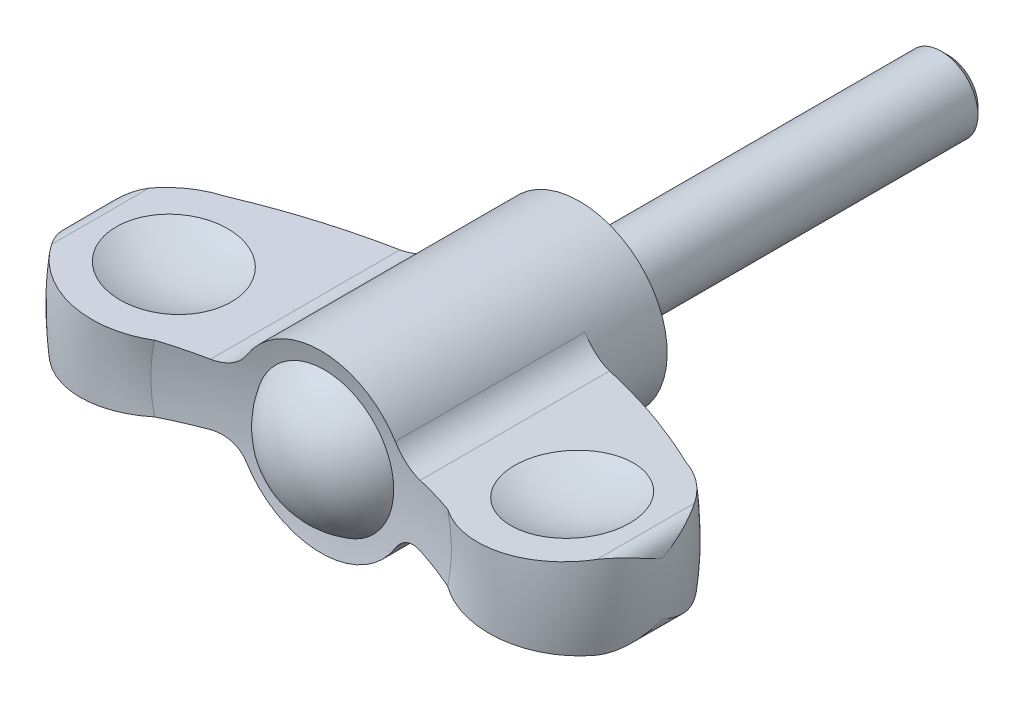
ISO-10303-21;
HEADER;
FILE_DESCRIPTION(('STEP AP214'),'2;1');
FILE_NAME('part.step','',(''),(''),'','','');
FILE_SCHEMA(('AUTOMOTIVE_DESIGN { 1 0 10303 214 1 1 1 1 }'));
ENDSEC;
DATA;
#1=APPLICATION_CONTEXT('core data for automotive mechanical design processes');
#2=APPLICATION_PROTOCOL_DEFINITION('international standard','automotive_design',2000,#1);
#3=PRODUCT_CONTEXT('',#1,'mechanical');
#4=PRODUCT('Part','Part','',(#3));
#5=PRODUCT_RELATED_PRODUCT_CATEGORY('part','',(#4));
#6=PRODUCT_DEFINITION_FORMATION('','',#4);
#7=PRODUCT_DEFINITION_CONTEXT('part definition',#1,'design');
#8=PRODUCT_DEFINITION('design','',#6,#7);
#9=PRODUCT_DEFINITION_SHAPE('','',#8);
#10=(LENGTH_UNIT() NAMED_UNIT(*) SI_UNIT(.MILLI.,.METRE.));
#11=(NAMED_UNIT(*) PLANE_ANGLE_UNIT() SI_UNIT($,.RADIAN.));
#12=(NAMED_UNIT(*) SI_UNIT($,.STERADIAN.) SOLID_ANGLE_UNIT());
#13=UNCERTAINTY_MEASURE_WITH_UNIT(LENGTH_MEASURE(1.E-05),#10,'distance_accuracy_value','');
#14=(GEOMETRIC_REPRESENTATION_CONTEXT(3) GLOBAL_UNCERTAINTY_ASSIGNED_CONTEXT((#13)) GLOBAL_UNIT_ASSIGNED_CONTEXT((#10,
#11,#12)) REPRESENTATION_CONTEXT('',''));
#15=CARTESIAN_POINT('',(0.,0.,0.));
#16=DIRECTION('',(0.,0.,1.));
#17=DIRECTION('',(1.,0.,0.));
#18=AXIS2_PLACEMENT_3D('',#15,#16,#17);
#19=CARTESIAN_POINT('',(0.,0.,76.6132216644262));
#20=DIRECTION('',(0.,0.,1.));
#21=DIRECTION('',(0.,1.,0.));
#22=AXIS2_PLACEMENT_3D('',#19,#20,#21);
#23=DEGENERATE_TOROIDAL_SURFACE('',#22,7.41274216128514,71.1525000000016,.F.);
#24=CARTESIAN_POINT('',(0.,0.,7.5));
#25=DIRECTION('',(0.,0.,1.));
#26=DIRECTION('',(0.,1.,0.));
#27=AXIS2_PLACEMENT_3D('',#24,#25,#26);
#28=CIRCLE('',#27,9.5);
#29=CARTESIAN_POINT('',(8.07537706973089,-5.00382705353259,7.5));
#30=VERTEX_POINT('',#29);
#31=CARTESIAN_POINT('',(8.07537711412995,5.0038269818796,7.5));
#32=VERTEX_POINT('',#31);
#33=EDGE_CURVE('E157',#30,#32,#28,.T.);
#34=ORIENTED_EDGE('',*,*,#33,.T.);
#35=CARTESIAN_POINT('',(8.07525319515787,5.00402698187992,7.50000000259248));
#36=CARTESIAN_POINT('',(8.12665454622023,4.92103773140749,7.49999174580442));
#37=CARTESIAN_POINT('',(8.18144861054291,4.84015820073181,7.50133541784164));
#38=CARTESIAN_POINT('',(8.29736182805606,4.68318005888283,7.50668034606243));
#39=CARTESIAN_POINT('',(8.35847989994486,4.607080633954,7.51068114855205));
#40=CARTESIAN_POINT('',(8.48644181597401,4.46037528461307,7.52128110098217));
#41=CARTESIAN_POINT('',(8.55327127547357,4.38975636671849,7.52787386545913));
#42=CARTESIAN_POINT('',(8.69224302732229,4.25429556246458,7.54356393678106));
#43=CARTESIAN_POINT('',(8.76438537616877,4.18945373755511,7.55266127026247));
#44=CARTESIAN_POINT('',(8.98795756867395,4.00427129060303,7.58354719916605));
#45=CARTESIAN_POINT('',(9.14667405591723,3.89311211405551,7.60894168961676));
#46=CARTESIAN_POINT('',(9.4786404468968,3.69815734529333,7.66816076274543));
#47=CARTESIAN_POINT('',(9.65189888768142,3.61437796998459,7.70199032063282));
#48=CARTESIAN_POINT('',(10.0125625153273,3.47403571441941,7.77763329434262));
#49=CARTESIAN_POINT('',(10.2002114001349,3.41819606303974,7.8196232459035));
#50=CARTESIAN_POINT('',(10.5805892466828,3.33774343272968,7.90948197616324));
#51=CARTESIAN_POINT('',(10.7733131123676,3.31310026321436,7.95734502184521));
#52=CARTESIAN_POINT('',(11.033653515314,3.30081513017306,8.02491673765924));
#53=CARTESIAN_POINT('',(11.1013248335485,3.29954054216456,8.04274730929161));
#54=CARTESIAN_POINT('',(11.236373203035,3.30079631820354,8.07885369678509));
#55=CARTESIAN_POINT('',(11.3037505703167,3.30331932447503,8.09712858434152));
#56=CARTESIAN_POINT('',(11.3709729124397,3.30772213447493,8.11561851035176));
#57=B_SPLINE_CURVE_WITH_KNOTS('',3,(#35,#36,#37,#38,#39,#40,#41,#42,#43,#44,#45,#46,#47,#48,#49,
#50,#51,#52,#53,#54,#55,#56),.UNSPECIFIED.,.F.,.F.,(4,2,2,2,2,2,2,2,2,2,4),(0.,
0.292752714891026,0.585455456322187,0.87744157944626,1.16943080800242,1.75277206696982,
2.33645821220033,2.93455895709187,3.53208044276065,3.74198071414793,3.95147483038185),.UNSPECIFIED.);
#58=CARTESIAN_POINT('',(11.3707729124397,3.30770903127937,8.11556349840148));
#59=VERTEX_POINT('',#58);
#60=EDGE_CURVE('E251',#32,#59,#57,.T.);
#61=ORIENTED_EDGE('',*,*,#60,.T.);
#62=CARTESIAN_POINT('',(24.9191403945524,4.19496480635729,13.4109144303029));
#63=CARTESIAN_POINT('',(23.8381391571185,4.12417217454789,12.8535823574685));
#64=CARTESIAN_POINT('',(22.7428134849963,4.05244146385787,12.324205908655));
#65=CARTESIAN_POINT('',(20.5293345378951,3.90748510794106,11.3241128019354));
#66=CARTESIAN_POINT('',(19.4112500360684,3.83426396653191,10.8532432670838));
#67=CARTESIAN_POINT('',(17.1522467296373,3.68632631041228,9.96991193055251));
#68=CARTESIAN_POINT('',(16.0113274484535,3.61160976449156,9.55745134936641));
#69=CARTESIAN_POINT('',(14.2836536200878,3.49846782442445,8.98318373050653));
#70=CARTESIAN_POINT('',(13.7042390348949,3.46052310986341,8.79894257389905));
#71=CARTESIAN_POINT('',(12.5407906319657,3.38433117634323,8.44572577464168));
#72=CARTESIAN_POINT('',(11.956756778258,3.34608395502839,8.27675025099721));
#73=CARTESIAN_POINT('',(11.3705729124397,3.30769593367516,8.11550848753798));
#74=B_SPLINE_CURVE_WITH_KNOTS('',3,(#62,#63,#64,#65,#66,#67,#68,#69,#70,#71,#72,#73),
.UNSPECIFIED.,.F.,.F.,(4,2,2,2,2,4),(0.,3.65437061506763,7.29898215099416,10.9436698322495,
12.771042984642,14.5984303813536),.UNSPECIFIED.);
#75=CARTESIAN_POINT('',(24.9187524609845,4.19493940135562,13.4107144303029));
#76=VERTEX_POINT('',#75);
#77=EDGE_CURVE('E242',#76,#59,#74,.T.);
#78=ORIENTED_EDGE('',*,*,#77,.F.);
#79=CARTESIAN_POINT('',(0.,0.,13.4107144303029));
#80=DIRECTION('',(0.,0.,1.));
#81=DIRECTION('',(0.,1.,0.));
#82=AXIS2_PLACEMENT_3D('',#79,#80,#81);
#83=CIRCLE('',#82,25.2693834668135);
#84=CARTESIAN_POINT('',(24.9187524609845,-4.19493940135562,13.4107144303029));
#85=VERTEX_POINT('',#84);
#86=EDGE_CURVE('E402',#85,#76,#83,.T.);
#87=ORIENTED_EDGE('',*,*,#86,.F.);
#88=CARTESIAN_POINT('',(11.3705729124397,-3.30769593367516,8.11550848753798));
#89=CARTESIAN_POINT('',(13.3194357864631,-3.43532310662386,8.65165350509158));
#90=CARTESIAN_POINT('',(15.2454387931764,-3.56145323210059,9.27335320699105));
#91=CARTESIAN_POINT('',(19.0285581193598,-3.80920223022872,10.6774595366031));
#92=CARTESIAN_POINT('',(20.8859409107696,-3.93083855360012,11.4591449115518));
#93=CARTESIAN_POINT('',(23.0778618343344,-4.07438311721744,12.4939591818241));
#94=CARTESIAN_POINT('',(23.4481408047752,-4.09863195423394,12.6727423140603));
#95=CARTESIAN_POINT('',(24.1858660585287,-4.14694412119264,13.0369148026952));
#96=CARTESIAN_POINT('',(24.5533094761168,-4.1710072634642,13.2223099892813));
#97=CARTESIAN_POINT('',(24.9191403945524,-4.19496480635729,13.4109144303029));
#98=B_SPLINE_CURVE_WITH_KNOTS('',3,(#88,#89,#90,#91,#92,#93,#94,#95,#96,#97),.UNSPECIFIED.,.F.,
.F.,(4,2,2,2,4),(0.,6.07517314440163,12.1235385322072,13.3591937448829,14.5959668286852),.UNSPECIFIED.);
#99=CARTESIAN_POINT('',(11.3707729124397,-3.30770903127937,8.11556349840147));
#100=VERTEX_POINT('',#99);
#101=EDGE_CURVE('E232',#100,#85,#98,.T.);
#102=ORIENTED_EDGE('',*,*,#101,.F.);
#103=CARTESIAN_POINT('',(11.3709729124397,-3.30772213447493,8.11561851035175));
#104=CARTESIAN_POINT('',(11.2701325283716,-3.30110509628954,8.08788118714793));
#105=CARTESIAN_POINT('',(11.1688817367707,-3.29874082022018,8.06061250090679));
#106=CARTESIAN_POINT('',(10.9662236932,-3.3025707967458,8.00721735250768));
#107=CARTESIAN_POINT('',(10.86481641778,-3.30876648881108,7.98109108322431));
#108=CARTESIAN_POINT('',(10.6624409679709,-3.32978238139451,7.93016922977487));
#109=CARTESIAN_POINT('',(10.5614733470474,-3.34461137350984,7.90537503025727));
#110=CARTESIAN_POINT('',(10.3608328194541,-3.38287019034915,7.85737208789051));
#111=CARTESIAN_POINT('',(10.2611598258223,-3.40629943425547,7.83416323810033));
#112=CARTESIAN_POINT('',(9.96486870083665,-3.48949811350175,7.76717843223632));
#113=CARTESIAN_POINT('',(9.77109378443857,-3.56216663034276,7.72607333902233));
#114=CARTESIAN_POINT('',(9.39755022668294,-3.74054378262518,7.65286990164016));
#115=CARTESIAN_POINT('',(9.21777675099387,-3.84624095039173,7.62076843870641));
#116=CARTESIAN_POINT('',(8.96611052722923,-4.02532517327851,7.58103605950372));
#117=CARTESIAN_POINT('',(8.88646307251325,-4.08719630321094,7.56933067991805));
#118=CARTESIAN_POINT('',(8.73245596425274,-4.21758210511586,7.54853793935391));
#119=CARTESIAN_POINT('',(8.65809406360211,-4.28609392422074,7.53944946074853));
#120=CARTESIAN_POINT('',(8.51538277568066,-4.42916784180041,7.52402786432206));
#121=CARTESIAN_POINT('',(8.44702397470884,-4.50372010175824,7.51769036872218));
#122=CARTESIAN_POINT('',(8.31677244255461,-4.65839173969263,7.50784180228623));
#123=CARTESIAN_POINT('',(8.25487550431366,-4.73850743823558,7.50432888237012));
#124=CARTESIAN_POINT('',(8.1753277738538,-4.85096452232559,7.50150027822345));
#125=CARTESIAN_POINT('',(8.15464683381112,-4.88116885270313,7.50093670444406));
#126=CARTESIAN_POINT('',(8.11423881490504,-4.94215928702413,7.50018643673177));
#127=CARTESIAN_POINT('',(8.09451057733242,-4.97294461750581,7.49999927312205));
#128=CARTESIAN_POINT('',(8.07525315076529,-5.00402705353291,7.50000000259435));
#129=B_SPLINE_CURVE_WITH_KNOTS('',3,(#103,#104,#105,#106,#107,#108,#109,#110,#111,#112,#113,
#114,#115,#116,#117,#118,#119,#120,#121,#122,#123,#124,#125,#126,#127,#128),.UNSPECIFIED.,.F.,
.F.,(4,2,2,2,2,2,2,2,2,2,2,2,4),(0.,0.314298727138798,0.628650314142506,0.943322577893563,
1.25797359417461,1.88762970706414,2.51706744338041,2.82134305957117,3.12548853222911,
3.42914821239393,3.73260894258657,3.8424257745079,3.95210549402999),.UNSPECIFIED.);
#130=EDGE_CURVE('E222',#100,#30,#129,.T.);
#131=ORIENTED_EDGE('',*,*,#130,.T.);
#132=EDGE_LOOP('',(#34,#61,#78,#87,#102,#131));
#133=FACE_BOUND('',#132,.T.);
#134=ADVANCED_FACE('F14',(#133),#23,.F.);
#135=CARTESIAN_POINT('',(0.,0.,22.4));
#136=DIRECTION('',(0.,0.,1.));
#137=DIRECTION('',(0.,1.,0.));
#138=AXIS2_PLACEMENT_3D('',#135,#136,#137);
#139=TOROIDAL_SURFACE('',#138,21.9,9.6);
#140=CARTESIAN_POINT('',(-18.1474454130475,-3.75149990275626,13.4105144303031));
#141=CARTESIAN_POINT('',(-17.8905850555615,-3.73467862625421,13.5060281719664));
#142=CARTESIAN_POINT('',(-17.6377608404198,-3.71812166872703,13.6124268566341));
#143=CARTESIAN_POINT('',(-17.1419285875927,-3.68565059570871,13.8461211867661));
#144=CARTESIAN_POINT('',(-16.8989202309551,-3.66973645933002,13.9734161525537));
#145=CARTESIAN_POINT('',(-16.4245099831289,-3.63866827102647,14.2479997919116));
#146=CARTESIAN_POINT('',(-16.1931050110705,-3.62351401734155,14.3952831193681));
#147=CARTESIAN_POINT('',(-15.743480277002,-3.59406898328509,14.7088327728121));
#148=CARTESIAN_POINT('',(-15.5252603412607,-3.57977819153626,14.8750988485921));
#149=CARTESIAN_POINT('',(-15.1034606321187,-3.55215536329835,15.2255617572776));
#150=CARTESIAN_POINT('',(-14.8998888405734,-3.53882384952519,15.4097682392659));
#151=CARTESIAN_POINT('',(-14.5090032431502,-3.51322552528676,15.794766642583));
#152=CARTESIAN_POINT('',(-14.321689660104,-3.50095872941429,15.9955587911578));
#153=CARTESIAN_POINT('',(-13.9647725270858,-3.4775849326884,16.4122828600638));
#154=CARTESIAN_POINT('',(-13.7951642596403,-3.46647762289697,16.6282107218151));
#155=CARTESIAN_POINT('',(-13.4749045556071,-3.44550444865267,17.073751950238));
#156=CARTESIAN_POINT('',(-13.3242529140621,-3.43563857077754,17.3033651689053));
#157=CARTESIAN_POINT('',(-13.0439598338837,-3.41728273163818,17.7732237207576));
#158=CARTESIAN_POINT('',(-12.9141954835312,-3.40878472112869,18.0133954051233));
#159=CARTESIAN_POINT('',(-12.6756273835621,-3.39316136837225,18.5039680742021));
#160=CARTESIAN_POINT('',(-12.5668227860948,-3.38603597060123,18.7543686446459));
#161=CARTESIAN_POINT('',(-12.3710778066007,-3.37321701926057,19.2636307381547));
#162=CARTESIAN_POINT('',(-12.2841387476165,-3.36752355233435,19.5224927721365));
#163=CARTESIAN_POINT('',(-12.1328924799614,-3.35761873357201,20.0467739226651));
#164=CARTESIAN_POINT('',(-12.0685848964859,-3.35340735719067,20.3121929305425));
#165=CARTESIAN_POINT('',(-11.9641647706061,-3.34656908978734,20.842606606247));
#166=CARTESIAN_POINT('',(-11.9236219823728,-3.34391402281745,21.1075162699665));
#167=CARTESIAN_POINT('',(-11.8652424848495,-3.34009086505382,21.6398358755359));
#168=CARTESIAN_POINT('',(-11.8474054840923,-3.33892275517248,21.9072457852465));
#169=CARTESIAN_POINT('',(-11.8345982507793,-3.33808403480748,22.4425774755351));
#170=CARTESIAN_POINT('',(-11.8396248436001,-3.33841321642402,22.7104991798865));
#171=CARTESIAN_POINT('',(-11.8724923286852,-3.34056564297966,23.2449323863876));
#172=CARTESIAN_POINT('',(-11.9003331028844,-3.34238888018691,23.5114438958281));
#173=CARTESIAN_POINT('',(-11.9780680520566,-3.34747958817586,24.0376567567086));
#174=CARTESIAN_POINT('',(-12.027669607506,-3.35072789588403,24.2974015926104));
#175=CARTESIAN_POINT('',(-12.1484267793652,-3.35863604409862,24.811805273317));
#176=CARTESIAN_POINT('',(-12.2195821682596,-3.36329586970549,25.0664641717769));
#177=CARTESIAN_POINT('',(-12.3828443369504,-3.37398758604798,25.5689078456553));
#178=CARTESIAN_POINT('',(-12.4749485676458,-3.38001930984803,25.8166934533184));
#179=CARTESIAN_POINT('',(-12.679407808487,-3.39340894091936,26.3038316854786));
#180=CARTESIAN_POINT('',(-12.7917703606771,-3.40076734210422,26.543181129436));
#181=CARTESIAN_POINT('',(-13.0369078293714,-3.41682090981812,27.0137884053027));
#182=CARTESIAN_POINT('',(-13.1698514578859,-3.42552712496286,27.2449579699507));
#183=CARTESIAN_POINT('',(-13.4544154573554,-3.44416265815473,27.6954567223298));
#184=CARTESIAN_POINT('',(-13.6060365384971,-3.45409202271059,27.9147854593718));
#185=CARTESIAN_POINT('',(-13.9268367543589,-3.47510059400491,28.3401572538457));
#186=CARTESIAN_POINT('',(-14.0960166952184,-3.48617985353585,28.5461997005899));
#187=CARTESIAN_POINT('',(-14.4507138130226,-3.50940826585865,28.9436423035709));
#188=CARTESIAN_POINT('',(-14.6362312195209,-3.52155743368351,29.1350422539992));
#189=CARTESIAN_POINT('',(-15.0260268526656,-3.54708437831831,29.5054914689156));
#190=CARTESIAN_POINT('',(-15.2305978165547,-3.56048132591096,29.6842314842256));
#191=CARTESIAN_POINT('',(-15.6538967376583,-3.58820233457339,30.0239900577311));
#192=CARTESIAN_POINT('',(-15.8726245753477,-3.6025263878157,30.1850087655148));
#193=CARTESIAN_POINT('',(-16.322752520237,-3.63200437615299,30.4882695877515));
#194=CARTESIAN_POINT('',(-16.5541555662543,-3.6471585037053,30.6305073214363));
#195=CARTESIAN_POINT('',(-17.0278914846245,-3.67818253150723,30.8951425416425));
#196=CARTESIAN_POINT('',(-17.2702206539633,-3.69405218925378,31.017546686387));
#197=CARTESIAN_POINT('',(-17.7669669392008,-3.72658312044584,31.2429802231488));
#198=CARTESIAN_POINT('',(-18.0214889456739,-3.74325126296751,31.3457775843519));
#199=CARTESIAN_POINT('',(-18.538265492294,-3.77709393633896,31.5295393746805));
#200=CARTESIAN_POINT('',(-18.8005200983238,-3.79426847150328,31.6105036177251));
#201=CARTESIAN_POINT('',(-19.3309113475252,-3.82900274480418,31.7500060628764));
#202=CARTESIAN_POINT('',(-19.5990481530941,-3.84656249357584,31.8085436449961));
#203=CARTESIAN_POINT('',(-20.1392890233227,-3.88194179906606,31.9027453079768));
#204=CARTESIAN_POINT('',(-20.4113930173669,-3.89976135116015,31.9384097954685));
#205=CARTESIAN_POINT('',(-20.9576381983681,-3.93553386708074,31.9865808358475));
#206=CARTESIAN_POINT('',(-21.2317794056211,-3.95348683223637,31.9990871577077));
#207=CARTESIAN_POINT('',(-21.7801364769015,-3.98939765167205,32.0008164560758));
#208=CARTESIAN_POINT('',(-22.0543523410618,-4.00735550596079,31.9900393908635));
#209=CARTESIAN_POINT('',(-22.6008596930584,-4.04314519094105,31.9452447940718));
#210=CARTESIAN_POINT('',(-22.8731513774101,-4.06097703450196,31.9112296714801));
#211=CARTESIAN_POINT('',(-23.4138724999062,-4.09638779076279,31.8201695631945));
#212=CARTESIAN_POINT('',(-23.6823019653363,-4.1139667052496,31.7631247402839));
#213=CARTESIAN_POINT('',(-24.2118784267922,-4.14864761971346,31.6267614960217));
#214=CARTESIAN_POINT('',(-24.4730575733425,-4.16575172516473,31.547568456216));
#215=CARTESIAN_POINT('',(-24.987795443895,-4.19946088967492,31.3673123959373));
#216=CARTESIAN_POINT('',(-25.2413540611,-4.2160659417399,31.2662490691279));
#217=CARTESIAN_POINT('',(-25.7391278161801,-4.24866415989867,31.0428965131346));
#218=CARTESIAN_POINT('',(-25.9833385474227,-4.26465703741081,30.9205974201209));
#219=CARTESIAN_POINT('',(-26.4605066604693,-4.29590583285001,30.655664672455));
#220=CARTESIAN_POINT('',(-26.6934645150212,-4.31116178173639,30.5130318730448));
#221=CARTESIAN_POINT('',(-27.1452633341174,-4.34074919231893,30.2092249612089));
#222=CARTESIAN_POINT('',(-27.3641711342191,-4.35508503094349,30.0481506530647));
#223=CARTESIAN_POINT('',(-27.7875859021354,-4.38281362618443,29.7080080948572));
#224=CARTESIAN_POINT('',(-27.9920934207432,-4.39620641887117,29.5289405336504));
#225=CARTESIAN_POINT('',(-28.3848624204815,-4.42192808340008,29.1544313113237));
#226=CARTESIAN_POINT('',(-28.5731528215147,-4.43425884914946,28.9590200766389));
#227=CARTESIAN_POINT('',(-28.9324617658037,-4.45778928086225,28.5530043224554));
#228=CARTESIAN_POINT('',(-29.1034908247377,-4.4689896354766,28.3424091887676));
#229=CARTESIAN_POINT('',(-29.319374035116,-4.48312739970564,28.0522910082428));
#230=CARTESIAN_POINT('',(-29.3724491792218,-4.48660318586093,27.9788119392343));
#231=CARTESIAN_POINT('',(-29.4764415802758,-4.49341344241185,27.8304567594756));
#232=CARTESIAN_POINT('',(-29.5273611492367,-4.49674806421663,27.7555822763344));
#233=CARTESIAN_POINT('',(-29.5772181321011,-4.50001309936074,27.679991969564));
#234=B_SPLINE_CURVE_WITH_KNOTS('',3,(#140,#141,#142,#143,#144,#145,#146,#147,#148,#149,#150,
#151,#152,#153,#154,#155,#156,#157,#158,#159,#160,#161,#162,#163,#164,#165,#166,#167,#168,#169,
#170,#171,#172,#173,#174,#175,#176,#177,#178,#179,#180,#181,#182,#183,#184,#185,#186,#187,#188,
#189,#190,#191,#192,#193,#194,#195,#196,#197,#198,#199,#200,#201,#202,#203,#204,#205,#206,#207,
#208,#209,#210,#211,#212,#213,#214,#215,#216,#217,#218,#219,#220,#221,#222,#223,#224,#225,#226,
#227,#228,#229,#230,#231,#232,#233),.UNSPECIFIED.,.F.,.F.,(4,2,2,2,2,2,2,2,2,2,2,2,2,2,2,2,2,2,
2,2,2,2,2,2,2,2,2,2,2,2,2,2,2,2,2,2,2,2,2,2,2,2,2,2,2,2,4),(0.,0.82342903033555,
1.64683128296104,2.47001373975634,3.29318534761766,4.11680216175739,4.9404302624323,
5.76383834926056,6.58723753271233,7.40559872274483,8.22392680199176,9.04230438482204,
9.86066841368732,10.6637182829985,11.4667578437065,12.2696859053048,13.0726098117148,
13.8650526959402,14.6574872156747,15.449825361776,16.2424591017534,17.0419728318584,
17.8415169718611,18.6410978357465,19.4406899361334,20.2556974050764,21.0706979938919,
21.8858883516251,22.7008044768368,23.5248358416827,24.3488742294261,25.1729353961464,
25.9969819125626,26.8210366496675,27.6450928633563,28.469063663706,29.2930286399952,
30.1124203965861,30.9318236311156,31.7516084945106,32.5713588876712,33.3868657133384,
34.2023413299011,35.0163312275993,35.8298222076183,36.1019244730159,36.3737270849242),.UNSPECIFIED.);
#235=CARTESIAN_POINT('',(-15.8916566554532,-3.60377276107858,30.1939503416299));
#236=VERTEX_POINT('',#235);
#237=CARTESIAN_POINT('',(-29.5770181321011,-4.5,27.6802951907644));
#238=VERTEX_POINT('',#237);
#239=EDGE_CURVE('E276',#236,#238,#234,.T.);
#240=ORIENTED_EDGE('',*,*,#239,.F.);
#241=CARTESIAN_POINT('',(0.,0.,30.1939503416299));
#242=DIRECTION('',(0.,0.,1.));
#243=DIRECTION('',(0.,1.,0.));
#244=AXIS2_PLACEMENT_3D('',#241,#242,#243);
#245=CIRCLE('',#244,16.2951504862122);
#246=CARTESIAN_POINT('',(-15.8916566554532,3.60377276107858,30.1939503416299));
#247=VERTEX_POINT('',#246);
#248=EDGE_CURVE('E210',#247,#236,#245,.T.);
#249=ORIENTED_EDGE('',*,*,#248,.F.);
#250=CARTESIAN_POINT('',(-29.577218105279,4.50001309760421,27.6799920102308));
#251=CARTESIAN_POINT('',(-29.4283813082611,4.49026607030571,27.9057071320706));
#252=CARTESIAN_POINT('',(-29.2699701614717,4.47989203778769,28.1250732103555));
#253=CARTESIAN_POINT('',(-28.9352574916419,4.45797236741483,28.5496181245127));
#254=CARTESIAN_POINT('',(-28.7589571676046,4.44642680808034,28.7547979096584));
#255=CARTESIAN_POINT('',(-28.3898682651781,4.42225590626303,29.1493363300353));
#256=CARTESIAN_POINT('',(-28.1970944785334,4.40963153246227,29.3387088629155));
#257=CARTESIAN_POINT('',(-27.7963194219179,4.38338556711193,29.7005094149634));
#258=CARTESIAN_POINT('',(-27.5883182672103,4.3697639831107,29.872937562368));
#259=CARTESIAN_POINT('',(-27.1584989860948,4.34161596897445,30.199703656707));
#260=CARTESIAN_POINT('',(-26.9366758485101,4.32708921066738,30.3540349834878));
#261=CARTESIAN_POINT('',(-26.4808650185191,4.29723906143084,30.6434656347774));
#262=CARTESIAN_POINT('',(-26.2468771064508,4.28191565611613,30.7785646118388));
#263=CARTESIAN_POINT('',(-25.7684462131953,4.25058416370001,31.0285776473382));
#264=CARTESIAN_POINT('',(-25.5240048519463,4.23457618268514,31.1434948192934));
#265=CARTESIAN_POINT('',(-25.0263706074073,4.20198710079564,31.3523874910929));
#266=CARTESIAN_POINT('',(-24.773177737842,4.1854060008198,31.4463630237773));
#267=CARTESIAN_POINT('',(-24.2590478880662,4.15173665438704,31.6129966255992));
#268=CARTESIAN_POINT('',(-23.9980896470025,4.13464701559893,31.685588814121));
#269=CARTESIAN_POINT('',(-23.4709078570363,4.10012292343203,31.8086173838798));
#270=CARTESIAN_POINT('',(-23.2046821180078,4.08268832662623,31.8590443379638));
#271=CARTESIAN_POINT('',(-22.6689091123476,4.04760161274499,31.9373839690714));
#272=CARTESIAN_POINT('',(-22.3993613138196,4.0299494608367,31.9652929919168));
#273=CARTESIAN_POINT('',(-21.8589964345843,3.99456203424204,31.9984159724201));
#274=CARTESIAN_POINT('',(-21.5881799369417,3.97682679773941,32.0036394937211));
#275=CARTESIAN_POINT('',(-21.0454404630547,3.94128386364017,31.9913795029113));
#276=CARTESIAN_POINT('',(-20.7735205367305,3.9234763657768,31.9737602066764));
#277=CARTESIAN_POINT('',(-20.2321124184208,3.88802061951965,31.9157373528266));
#278=CARTESIAN_POINT('',(-19.9626242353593,3.8703723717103,31.8753337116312));
#279=CARTESIAN_POINT('',(-19.4280257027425,3.83536257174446,31.7720671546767));
#280=CARTESIAN_POINT('',(-19.1629144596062,3.81800096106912,31.7092088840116));
#281=CARTESIAN_POINT('',(-18.6387730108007,3.78367597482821,31.5614710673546));
#282=CARTESIAN_POINT('',(-18.3797450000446,3.76671274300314,31.4765837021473));
#283=CARTESIAN_POINT('',(-17.8682212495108,3.73321406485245,31.2848646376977));
#284=CARTESIAN_POINT('',(-17.6157711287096,3.71668160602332,31.177910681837));
#285=CARTESIAN_POINT('',(-17.1207307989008,3.6842623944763,30.9431230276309));
#286=CARTESIAN_POINT('',(-16.8781406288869,3.66837564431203,30.8152892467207));
#287=CARTESIAN_POINT('',(-16.4045275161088,3.63735965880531,30.5396362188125));
#288=CARTESIAN_POINT('',(-16.1735051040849,3.62223045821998,30.3918160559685));
#289=CARTESIAN_POINT('',(-15.7246794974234,3.59283775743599,30.0772205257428));
#290=CARTESIAN_POINT('',(-15.5068766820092,3.57857428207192,29.9104446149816));
#291=CARTESIAN_POINT('',(-15.0856203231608,3.55098703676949,29.5587225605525));
#292=CARTESIAN_POINT('',(-14.8821981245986,3.53766531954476,29.3737387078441));
#293=CARTESIAN_POINT('',(-14.4917116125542,3.51209313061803,28.9871837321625));
#294=CARTESIAN_POINT('',(-14.3046468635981,3.49984263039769,28.7856130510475));
#295=CARTESIAN_POINT('',(-13.9482722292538,3.47650436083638,28.3672761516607));
#296=CARTESIAN_POINT('',(-13.7789624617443,3.46541659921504,28.1505098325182));
#297=CARTESIAN_POINT('',(-13.4594078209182,3.4444895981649,27.7032976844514));
#298=CARTESIAN_POINT('',(-13.3091625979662,3.43465033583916,27.4728521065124));
#299=CARTESIAN_POINT('',(-13.0300075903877,3.4163690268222,27.0017206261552));
#300=CARTESIAN_POINT('',(-12.9009427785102,3.40791682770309,26.7611269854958));
#301=CARTESIAN_POINT('',(-12.6638563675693,3.39239050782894,26.269856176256));
#302=CARTESIAN_POINT('',(-12.5558264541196,3.38531584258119,26.0191830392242));
#303=CARTESIAN_POINT('',(-12.3616487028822,3.37259952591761,25.5094385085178));
#304=CARTESIAN_POINT('',(-12.2755026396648,3.36695799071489,25.2503664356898));
#305=CARTESIAN_POINT('',(-12.125856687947,3.35715797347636,24.7257346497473));
#306=CARTESIAN_POINT('',(-12.0623564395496,3.35299946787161,24.4601750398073));
#307=CARTESIAN_POINT('',(-11.9595441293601,3.34626649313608,23.9295575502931));
#308=CARTESIAN_POINT('',(-11.9198013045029,3.34366381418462,23.6645834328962));
#309=CARTESIAN_POINT('',(-11.8630211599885,3.33994539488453,23.1322038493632));
#310=CARTESIAN_POINT('',(-11.8459835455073,3.33882963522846,22.8647984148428));
#311=CARTESIAN_POINT('',(-11.8347668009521,3.33809507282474,22.3295252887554));
#312=CARTESIAN_POINT('',(-11.8405860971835,3.33847616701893,22.0616576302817));
#313=CARTESIAN_POINT('',(-11.8750272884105,3.34073165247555,21.5273997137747));
#314=CARTESIAN_POINT('',(-11.9036490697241,3.34260603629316,21.2610094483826));
#315=CARTESIAN_POINT('',(-11.9829240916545,3.34779760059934,20.7350583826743));
#316=CARTESIAN_POINT('',(-12.033288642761,3.35109587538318,20.4754538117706));
#317=CARTESIAN_POINT('',(-12.1555550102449,3.35910285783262,19.961393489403));
#318=CARTESIAN_POINT('',(-12.2274566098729,3.36381155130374,19.7069376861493));
#319=CARTESIAN_POINT('',(-12.3921774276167,3.37459879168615,19.2049950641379));
#320=CARTESIAN_POINT('',(-12.4849912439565,3.38067698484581,18.9575064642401));
#321=CARTESIAN_POINT('',(-12.6908448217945,3.39415792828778,18.470999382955));
#322=CARTESIAN_POINT('',(-12.8038936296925,3.40156127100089,18.2319847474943));
#323=CARTESIAN_POINT('',(-13.050399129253,3.41770442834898,17.7620583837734));
#324=CARTESIAN_POINT('',(-13.1840279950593,3.42645551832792,17.5312373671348));
#325=CARTESIAN_POINT('',(-13.4698675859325,3.4451745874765,17.0815911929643));
#326=CARTESIAN_POINT('',(-13.6220707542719,3.45514207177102,16.8627612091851));
#327=CARTESIAN_POINT('',(-13.9440945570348,3.4762307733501,16.4382825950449));
#328=CARTESIAN_POINT('',(-14.113927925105,3.48735282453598,16.2326436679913));
#329=CARTESIAN_POINT('',(-14.4698944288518,3.51066436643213,15.836072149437));
#330=CARTESIAN_POINT('',(-14.6560271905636,3.52285383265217,15.6451392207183));
#331=CARTESIAN_POINT('',(-15.0471805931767,3.54846969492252,15.2755429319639));
#332=CARTESIAN_POINT('',(-15.2525053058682,3.56191600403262,15.097202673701));
#333=CARTESIAN_POINT('',(-15.6772923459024,3.58973446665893,14.7583242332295));
#334=CARTESIAN_POINT('',(-15.8967545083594,3.60410660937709,14.5977858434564));
#335=CARTESIAN_POINT('',(-16.3478939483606,3.63365083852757,14.2958496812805));
#336=CARTESIAN_POINT('',(-16.5795509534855,3.64882159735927,14.1544214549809));
#337=CARTESIAN_POINT('',(-17.0537037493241,3.67987292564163,13.8914238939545));
#338=CARTESIAN_POINT('',(-17.2961933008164,3.69575308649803,13.769843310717));
#339=CARTESIAN_POINT('',(-17.6425873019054,3.71843774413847,13.6138611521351));
#340=CARTESIAN_POINT('',(-17.7426773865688,3.7249924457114,13.5707938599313));
#341=CARTESIAN_POINT('',(-17.9441132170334,3.7381840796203,13.4880908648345));
#342=CARTESIAN_POINT('',(-18.045457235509,3.74482089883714,13.4484509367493));
#343=CARTESIAN_POINT('',(-18.1474454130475,3.75149990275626,13.4105144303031));
#344=B_SPLINE_CURVE_WITH_KNOTS('',3,(#250,#251,#252,#253,#254,#255,#256,#257,#258,#259,#260,
#261,#262,#263,#264,#265,#266,#267,#268,#269,#270,#271,#272,#273,#274,#275,#276,#277,#278,#279,
#280,#281,#282,#283,#284,#285,#286,#287,#288,#289,#290,#291,#292,#293,#294,#295,#296,#297,#298,
#299,#300,#301,#302,#303,#304,#305,#306,#307,#308,#309,#310,#311,#312,#313,#314,#315,#316,#317,
#318,#319,#320,#321,#322,#323,#324,#325,#326,#327,#328,#329,#330,#331,#332,#333,#334,#335,#336,
#337,#338,#339,#340,#341,#342,#343),.UNSPECIFIED.,.F.,.F.,(4,2,2,2,2,2,2,2,2,2,2,2,2,2,2,2,2,2,
2,2,2,2,2,2,2,2,2,2,2,2,2,2,2,2,2,2,2,2,2,2,2,2,2,2,2,2,4),(0.,0.811383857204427,
1.62271336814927,2.43332187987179,3.24392425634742,4.05482224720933,4.86573488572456,
5.67652231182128,6.48730846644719,7.30056707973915,8.11417124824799,8.92790742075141,
9.7413005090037,10.5595508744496,11.3778042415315,12.1958884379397,13.0142634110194,
13.8373004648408,14.6603407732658,15.4834188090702,16.3065204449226,17.1313641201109,
17.9561858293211,18.7810130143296,19.6058250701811,20.4243011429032,21.2424530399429,
22.0606712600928,22.8788764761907,23.6817568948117,24.4846268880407,25.2874416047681,
26.0902523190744,26.8827166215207,27.6751729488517,28.4674248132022,29.2600317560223,
30.0596712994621,30.8589865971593,31.658883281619,32.4587616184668,33.2746912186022,
34.090611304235,34.9052154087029,35.7193562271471,36.0467859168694,36.3738060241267),.UNSPECIFIED.);
#345=CARTESIAN_POINT('',(-29.577018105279,4.5,27.6802952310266));
#346=VERTEX_POINT('',#345);
#347=EDGE_CURVE('E298',#346,#247,#344,.T.);
#348=ORIENTED_EDGE('',*,*,#347,.F.);
#349=CARTESIAN_POINT('',(-31.369564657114,2.86363636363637,22.4));
#350=CARTESIAN_POINT('',(-31.3693228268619,2.86628559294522,22.4059654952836));
#351=CARTESIAN_POINT('',(-31.3690751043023,2.86893438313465,22.4119311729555));
#352=CARTESIAN_POINT('',(-31.3455550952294,3.11453943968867,22.9652019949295));
#353=CARTESIAN_POINT('',(-31.2727100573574,3.35362322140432,23.5139845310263));
#354=CARTESIAN_POINT('',(-31.0906514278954,3.68216340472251,24.3317563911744));
#355=CARTESIAN_POINT('',(-31.0177760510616,3.78670945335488,24.6035877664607));
#356=CARTESIAN_POINT('',(-30.8477677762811,3.98135441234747,25.1449637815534));
#357=CARTESIAN_POINT('',(-30.7506472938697,4.07146067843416,25.4145095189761));
#358=CARTESIAN_POINT('',(-30.5719332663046,4.20252900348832,25.8529322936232));
#359=CARTESIAN_POINT('',(-30.4974342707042,4.24947683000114,26.0229493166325));
#360=CARTESIAN_POINT('',(-30.3388744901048,4.33328283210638,26.3608778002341));
#361=CARTESIAN_POINT('',(-30.2548212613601,4.37014890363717,26.5287908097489));
#362=CARTESIAN_POINT('',(-30.0769796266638,4.43174329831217,26.8627513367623));
#363=CARTESIAN_POINT('',(-29.9831491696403,4.45641633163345,27.0287870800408));
#364=CARTESIAN_POINT('',(-29.8357178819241,4.48201227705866,27.2752518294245));
#365=CARTESIAN_POINT('',(-29.7853951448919,4.48864307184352,27.3570723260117));
#366=CARTESIAN_POINT('',(-29.6826484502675,4.4976362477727,27.5196657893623));
#367=CARTESIAN_POINT('',(-29.630223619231,4.49999683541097,27.6004383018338));
#368=CARTESIAN_POINT('',(-29.5768181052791,4.4999999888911,27.6805954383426));
#369=B_SPLINE_CURVE_WITH_KNOTS('',3,(#349,#350,#351,#352,#353,#354,#355,#356,#357,#358,#359,
#360,#361,#362,#363,#364,#365,#366,#367,#368),.UNSPECIFIED.,.F.,.F.,(4,2,2,2,2,2,2,2,2,4),(0.,
0.0195959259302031,1.81731826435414,2.71712331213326,3.61646852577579,4.19044381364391,
4.76396827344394,5.34007007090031,5.62881792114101,5.91768701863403),.UNSPECIFIED.);
#370=CARTESIAN_POINT('',(-31.369564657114,2.86363636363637,22.4));
#371=VERTEX_POINT('',#370);
#372=EDGE_CURVE('E360',#371,#346,#369,.T.);
#373=ORIENTED_EDGE('',*,*,#372,.F.);
#374=CARTESIAN_POINT('',(-29.576818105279,4.49999998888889,17.1194045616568));
#375=CARTESIAN_POINT('',(-29.619139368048,4.50000102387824,17.1829266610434));
#376=CARTESIAN_POINT('',(-29.6608485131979,4.49851722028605,17.2468391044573));
#377=CARTESIAN_POINT('',(-29.7429683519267,4.49280699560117,17.3753522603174));
#378=CARTESIAN_POINT('',(-29.7833793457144,4.48858121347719,17.4399528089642));
#379=CARTESIAN_POINT('',(-29.9024609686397,4.47214705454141,17.6344933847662));
#380=CARTESIAN_POINT('',(-29.9791105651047,4.45618046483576,17.765367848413));
#381=CARTESIAN_POINT('',(-30.1263186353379,4.41582925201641,18.0284830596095));
#382=CARTESIAN_POINT('',(-30.1969002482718,4.39147855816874,18.1607162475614));
#383=CARTESIAN_POINT('',(-30.3321494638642,4.33558288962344,18.4267422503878));
#384=CARTESIAN_POINT('',(-30.3968138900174,4.30403408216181,18.5605358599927));
#385=CARTESIAN_POINT('',(-30.5626786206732,4.21088535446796,18.9222641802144));
#386=CARTESIAN_POINT('',(-30.6582400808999,4.1435864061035,19.1513508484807));
#387=CARTESIAN_POINT('',(-30.8316829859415,3.99568952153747,19.6118454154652));
#388=CARTESIAN_POINT('',(-30.9095558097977,3.91508513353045,19.8432543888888));
#389=CARTESIAN_POINT('',(-31.1166837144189,3.65806718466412,20.540705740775));
#390=CARTESIAN_POINT('',(-31.219251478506,3.46657224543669,21.009542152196));
#391=CARTESIAN_POINT('',(-31.3069727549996,3.20184757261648,21.6292554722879));
#392=CARTESIAN_POINT('',(-31.3245600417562,3.13661935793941,21.7798368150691));
#393=CARTESIAN_POINT('',(-31.3522803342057,3.00489991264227,22.080989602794));
#394=CARTESIAN_POINT('',(-31.3624220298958,2.93841024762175,22.2315608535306));
#395=CARTESIAN_POINT('',(-31.3690750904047,2.86893445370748,22.3880686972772));
#396=CARTESIAN_POINT('',(-31.3693228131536,2.86628566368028,22.3940343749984));
#397=CARTESIAN_POINT('',(-31.369564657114,2.86363636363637,22.4));
#398=B_SPLINE_CURVE_WITH_KNOTS('',3,(#374,#375,#376,#377,#378,#379,#380,#381,#382,#383,#384,
#385,#386,#387,#388,#389,#390,#391,#392,#393,#394,#395,#396,#397),.UNSPECIFIED.,.F.,.F.,(4,2,2,
2,2,2,2,2,2,2,2,4),(0.,0.228945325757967,0.457837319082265,0.914918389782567,1.37017104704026,
1.82566667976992,2.59598824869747,3.36668444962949,4.90952775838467,5.40460012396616,
5.89909375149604,5.91868967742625),.UNSPECIFIED.);
#399=CARTESIAN_POINT('',(-29.577018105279,4.5,17.1197047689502));
#400=VERTEX_POINT('',#399);
#401=EDGE_CURVE('E354',#400,#371,#398,.T.);
#402=ORIENTED_EDGE('',*,*,#401,.F.);
#403=CARTESIAN_POINT('',(-24.918217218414,4.19490434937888,13.4105144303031));
#404=CARTESIAN_POINT('',(-25.1747287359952,4.2117027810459,13.5063205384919));
#405=CARTESIAN_POINT('',(-25.4271515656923,4.22823345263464,13.6131252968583));
#406=CARTESIAN_POINT('',(-25.9220334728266,4.26064228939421,13.847863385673));
#407=CARTESIAN_POINT('',(-26.1644920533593,4.27652042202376,13.9757977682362));
#408=CARTESIAN_POINT('',(-26.6315223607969,4.30710531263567,14.2483504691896));
#409=CARTESIAN_POINT('',(-26.8563943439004,4.32183173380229,14.3924524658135));
#410=CARTESIAN_POINT('',(-27.2933789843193,4.35044899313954,14.6988790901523));
#411=CARTESIAN_POINT('',(-27.5054935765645,4.3643399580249,14.8612009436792));
#412=CARTESIAN_POINT('',(-27.888316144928,4.38941025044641,15.180307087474));
#413=CARTESIAN_POINT('',(-28.0607863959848,4.40070498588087,15.3349749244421));
#414=CARTESIAN_POINT('',(-28.3941147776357,4.4225340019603,15.6563910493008));
#415=CARTESIAN_POINT('',(-28.5549737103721,4.43306833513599,15.8231385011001));
#416=CARTESIAN_POINT('',(-28.8677866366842,4.45355383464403,16.1718241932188));
#417=CARTESIAN_POINT('',(-29.0194509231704,4.46348602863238,16.354023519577));
#418=CARTESIAN_POINT('',(-29.3089338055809,4.48244368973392,16.72919338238));
#419=CARTESIAN_POINT('',(-29.4467504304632,4.49146902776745,16.9221654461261));
#420=CARTESIAN_POINT('',(-29.577218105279,4.50001309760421,17.1200079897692));
#421=B_SPLINE_CURVE_WITH_KNOTS('',3,(#403,#404,#405,#406,#407,#408,#409,#410,#411,#412,#413,
#414,#415,#416,#417,#418,#419,#420),.UNSPECIFIED.,.F.,.F.,(4,2,2,2,2,2,2,2,4),(0.,
0.822759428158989,1.64555983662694,2.44710662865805,3.24853154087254,3.94375872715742,
4.63893783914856,5.35009750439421,6.06135825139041),.UNSPECIFIED.);
#422=CARTESIAN_POINT('',(-24.9187524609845,4.19493940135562,13.4107144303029));
#423=VERTEX_POINT('',#422);
#424=EDGE_CURVE('E277',#423,#400,#421,.T.);
#425=ORIENTED_EDGE('',*,*,#424,.F.);
#426=CARTESIAN_POINT('',(-24.9187524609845,-4.19493940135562,13.4107144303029));
#427=VERTEX_POINT('',#426);
#428=EDGE_CURVE('E399',#423,#427,#83,.T.);
#429=ORIENTED_EDGE('',*,*,#428,.T.);
#430=CARTESIAN_POINT('',(-29.5772181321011,-4.50001309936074,17.120008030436));
#431=CARTESIAN_POINT('',(-29.4265102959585,-4.49014354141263,16.8914517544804));
#432=CARTESIAN_POINT('',(-29.2659808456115,-4.4796307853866,16.6694035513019));
#433=CARTESIAN_POINT('',(-28.926581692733,-4.45740420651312,16.2398574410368));
#434=CARTESIAN_POINT('',(-28.7477118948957,-4.44569037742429,16.0323596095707));
#435=CARTESIAN_POINT('',(-28.3777669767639,-4.42146341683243,15.6385922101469));
#436=CARTESIAN_POINT('',(-28.1871253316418,-4.40897867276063,15.45191331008));
#437=CARTESIAN_POINT('',(-27.7910307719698,-4.38303922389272,15.0951091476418));
#438=CARTESIAN_POINT('',(-27.5855799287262,-4.36958465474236,14.9249815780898));
#439=CARTESIAN_POINT('',(-27.188874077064,-4.34360517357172,14.6233879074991));
#440=CARTESIAN_POINT('',(-26.9992422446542,-4.33118656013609,14.4897704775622));
#441=CARTESIAN_POINT('',(-26.6108443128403,-4.30575114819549,14.2366062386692));
#442=CARTESIAN_POINT('',(-26.4120783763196,-4.29273436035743,14.1170591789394));
#443=CARTESIAN_POINT('',(-26.0017910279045,-4.26586545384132,13.890069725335));
#444=CARTESIAN_POINT('',(-25.7900813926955,-4.25200100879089,13.7829689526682));
#445=CARTESIAN_POINT('',(-25.3593416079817,-4.22379271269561,13.5846713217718));
#446=CARTESIAN_POINT('',(-25.1403106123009,-4.20944880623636,13.4934763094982));
#447=CARTESIAN_POINT('',(-24.918217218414,-4.19490434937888,13.4105144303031));
#448=B_SPLINE_CURVE_WITH_KNOTS('',3,(#430,#431,#432,#433,#434,#435,#436,#437,#438,#439,#440,
#441,#442,#443,#444,#445,#446,#447),.UNSPECIFIED.,.F.,.F.,(4,2,2,2,2,2,2,2,4),(0.,
0.821594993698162,1.64319425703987,2.44361485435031,3.24392371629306,3.94026356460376,
4.63659100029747,5.34893291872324,6.06135745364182),.UNSPECIFIED.);
#449=CARTESIAN_POINT('',(-29.5770181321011,-4.5,17.1197048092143));
#450=VERTEX_POINT('',#449);
#451=EDGE_CURVE('E530',#450,#427,#448,.T.);
#452=ORIENTED_EDGE('',*,*,#451,.F.);
#453=CARTESIAN_POINT('',(-31.369564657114,-2.86363636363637,22.4));
#454=CARTESIAN_POINT('',(-31.3693228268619,-2.86628559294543,22.3940345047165));
#455=CARTESIAN_POINT('',(-31.3690751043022,-2.86893438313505,22.3880688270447));
#456=CARTESIAN_POINT('',(-31.3455550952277,-3.11453943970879,21.8347980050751));
#457=CARTESIAN_POINT('',(-31.272710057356,-3.35362322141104,21.2860154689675));
#458=CARTESIAN_POINT('',(-31.0906514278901,-3.68216340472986,20.468243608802));
#459=CARTESIAN_POINT('',(-31.0177760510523,-3.78670945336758,20.1964122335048));
#460=CARTESIAN_POINT('',(-30.8477677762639,-3.98135441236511,19.6550362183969));
#461=CARTESIAN_POINT('',(-30.7506472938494,-4.07146067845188,19.3854904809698));
#462=CARTESIAN_POINT('',(-30.5719332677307,-4.20252900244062,18.947067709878));
#463=CARTESIAN_POINT('',(-30.4974342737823,-4.2494768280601,18.7770506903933));
#464=CARTESIAN_POINT('',(-30.3388744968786,-4.33328282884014,18.4391222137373));
#465=CARTESIAN_POINT('',(-30.2548212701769,-4.37014889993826,18.2712092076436));
#466=CARTESIAN_POINT('',(-30.0769796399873,-4.43174329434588,17.9372486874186));
#467=CARTESIAN_POINT('',(-29.9831491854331,-4.45641632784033,17.7712129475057));
#468=CARTESIAN_POINT('',(-29.8357179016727,-4.48201227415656,17.5247482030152));
#469=CARTESIAN_POINT('',(-29.7853951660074,-4.48864306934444,17.4429277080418));
#470=CARTESIAN_POINT('',(-29.6826484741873,-4.49763624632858,17.2803342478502));
#471=CARTESIAN_POINT('',(-29.6302236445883,-4.49999683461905,17.1995617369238));
#472=CARTESIAN_POINT('',(-29.5768181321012,-4.49999998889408,17.119404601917));
#473=B_SPLINE_CURVE_WITH_KNOTS('',3,(#453,#454,#455,#456,#457,#458,#459,#460,#461,#462,#463,
#464,#465,#466,#467,#468,#469,#470,#471,#472),.UNSPECIFIED.,.F.,.F.,(4,2,2,2,2,2,2,2,2,4),(0.,
0.0195959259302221,1.81731826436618,2.71712331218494,3.61646852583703,4.19044380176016,
4.76396824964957,5.34007003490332,5.62881787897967,5.91768697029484),.UNSPECIFIED.);
#474=CARTESIAN_POINT('',(-31.369564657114,-2.86363636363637,22.4));
#475=VERTEX_POINT('',#474);
#476=EDGE_CURVE('E372',#475,#450,#473,.T.);
#477=ORIENTED_EDGE('',*,*,#476,.F.);
#478=CARTESIAN_POINT('',(-29.576818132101,-4.49999998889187,27.6805953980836));
#479=CARTESIAN_POINT('',(-29.6191393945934,-4.50000102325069,27.6170732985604));
#480=CARTESIAN_POINT('',(-29.6608485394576,-4.49851721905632,27.5531608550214));
#481=CARTESIAN_POINT('',(-29.7429683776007,-4.49280699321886,27.4246476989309));
#482=CARTESIAN_POINT('',(-29.7833793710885,-4.48858121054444,27.3600471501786));
#483=CARTESIAN_POINT('',(-29.9024609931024,-4.47214705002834,27.1655065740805));
#484=CARTESIAN_POINT('',(-29.9791105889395,-4.45618045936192,27.0346321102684));
#485=CARTESIAN_POINT('',(-30.1263186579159,-4.41582924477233,26.7715168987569));
#486=CARTESIAN_POINT('',(-30.1969002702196,-4.39147855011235,26.6392837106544));
#487=CARTESIAN_POINT('',(-30.332149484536,-4.33558288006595,26.3732577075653));
#488=CARTESIAN_POINT('',(-30.3968139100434,-4.30403407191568,26.2394640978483));
#489=CARTESIAN_POINT('',(-30.5626786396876,-4.21088534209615,25.8777357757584));
#490=CARTESIAN_POINT('',(-30.6582400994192,-4.14358639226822,25.6486491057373));
#491=CARTESIAN_POINT('',(-30.8316830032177,-3.99568950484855,25.1881545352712));
#492=CARTESIAN_POINT('',(-30.9095558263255,-3.91508511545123,24.956745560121));
#493=CARTESIAN_POINT('',(-31.1166837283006,-3.65806716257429,24.2592942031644));
#494=CARTESIAN_POINT('',(-31.2192514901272,-3.46657222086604,23.7904577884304));
#495=CARTESIAN_POINT('',(-31.3069727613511,-3.20184755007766,23.1707444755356));
#496=CARTESIAN_POINT('',(-31.324560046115,-3.13661933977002,23.0201631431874));
#497=CARTESIAN_POINT('',(-31.3522803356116,-3.00489990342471,22.7190103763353));
#498=CARTESIAN_POINT('',(-31.3624220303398,-2.93841024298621,22.5684391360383));
#499=CARTESIAN_POINT('',(-31.3690750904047,-2.86893445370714,22.4119313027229));
#500=CARTESIAN_POINT('',(-31.3693228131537,-2.8662856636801,22.4059656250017));
#501=CARTESIAN_POINT('',(-31.369564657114,-2.86363636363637,22.4));
#502=B_SPLINE_CURVE_WITH_KNOTS('',3,(#478,#479,#480,#481,#482,#483,#484,#485,#486,#487,#488,
#489,#490,#491,#492,#493,#494,#495,#496,#497,#498,#499,#500,#501),.UNSPECIFIED.,.F.,.F.,(4,2,2,
2,2,2,2,2,2,2,2,4),(0.,0.228945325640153,0.457837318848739,0.914918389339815,1.37017104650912,
1.82566667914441,2.59598825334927,3.3666844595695,4.90952777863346,5.4046001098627,
5.89909370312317,5.91868962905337),.UNSPECIFIED.);
#503=EDGE_CURVE('E366',#238,#475,#502,.T.);
#504=ORIENTED_EDGE('',*,*,#503,.F.);
#505=EDGE_LOOP('',(#240,#249,#348,#373,#402,#425,#429,#452,#477,#504));
#506=FACE_BOUND('',#505,.T.);
#507=ADVANCED_FACE('F391',(#506),#139,.T.);
#508=CARTESIAN_POINT('',(0.,0.,0.));
#509=DIRECTION('',(0.,0.,1.));
#510=DIRECTION('',(0.,1.,0.));
#511=AXIS2_PLACEMENT_3D('',#508,#509,#510);
#512=PLANE('',#511);
#513=CARTESIAN_POINT('',(0.,0.,0.));
#514=DIRECTION('',(0.,0.,1.));
#515=DIRECTION('',(0.,1.,0.));
#516=AXIS2_PLACEMENT_3D('',#513,#514,#515);
#517=CIRCLE('',#516,4.);
#518=CARTESIAN_POINT('',(0.,4.,0.));
#519=VERTEX_POINT('',#518);
#520=EDGE_CURVE('E552',#519,#519,#517,.F.);
#521=ORIENTED_EDGE('',*,*,#520,.F.);
#522=EDGE_LOOP('',(#521));
#523=FACE_BOUND('',#522,.T.);
#524=CARTESIAN_POINT('',(0.,0.,0.));
#525=DIRECTION('',(0.,0.,1.));
#526=DIRECTION('',(0.,1.,0.));
#527=AXIS2_PLACEMENT_3D('',#524,#525,#526);
#528=CIRCLE('',#527,9.5);
#529=CARTESIAN_POINT('',(0.,9.5,0.));
#530=VERTEX_POINT('',#529);
#531=EDGE_CURVE('E146',#530,#530,#528,.T.);
#532=ORIENTED_EDGE('',*,*,#531,.F.);
#533=EDGE_LOOP('',(#532));
#534=FACE_BOUND('',#533,.T.);
#535=ADVANCED_FACE('F395',(#523,#534),#512,.F.);
#536=CARTESIAN_POINT('',(0.,0.,27.));
#537=DIRECTION('',(0.,0.,1.));
#538=DIRECTION('',(0.,1.,0.));
#539=AXIS2_PLACEMENT_3D('',#536,#537,#538);
#540=CYLINDRICAL_SURFACE('',#539,9.5);
#541=CARTESIAN_POINT('',(-8.07537698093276,5.00382719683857,7.5));
#542=VERTEX_POINT('',#541);
#543=CARTESIAN_POINT('',(-8.07537699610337,-5.00382717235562,7.5));
#544=VERTEX_POINT('',#543);
#545=EDGE_CURVE('E398',#542,#544,#28,.T.);
#546=ORIENTED_EDGE('',*,*,#545,.F.);
#547=DIRECTION('',(0.,0.,-1.));
#548=VECTOR('',#547,1.);
#549=CARTESIAN_POINT('',(-8.07537698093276,5.00382719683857,63.));
#550=LINE('',#549,#548);
#551=CARTESIAN_POINT('',(-8.07537698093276,5.00382719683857,28.0583845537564));
#552=VERTEX_POINT('',#551);
#553=EDGE_CURVE('E447',#552,#542,#550,.T.);
#554=ORIENTED_EDGE('',*,*,#553,.F.);
#555=CARTESIAN_POINT('',(0.,0.,28.0583845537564));
#556=DIRECTION('',(0.,0.,1.));
#557=DIRECTION('',(0.,1.,0.));
#558=AXIS2_PLACEMENT_3D('',#555,#556,#557);
#559=CIRCLE('',#558,9.5);
#560=CARTESIAN_POINT('',(8.07537711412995,5.0038269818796,28.0583845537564));
#561=VERTEX_POINT('',#560);
#562=EDGE_CURVE('E516',#561,#552,#559,.T.);
#563=ORIENTED_EDGE('',*,*,#562,.F.);
#564=DIRECTION('',(0.,0.,-1.));
#565=VECTOR('',#564,1.);
#566=CARTESIAN_POINT('',(8.07537711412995,5.0038269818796,63.));
#567=LINE('',#566,#565);
#568=EDGE_CURVE('E445',#561,#32,#567,.T.);
#569=ORIENTED_EDGE('',*,*,#568,.T.);
#570=ORIENTED_EDGE('',*,*,#33,.F.);
#571=DIRECTION('',(0.,0.,-1.));
#572=VECTOR('',#571,1.);
#573=CARTESIAN_POINT('',(8.07537706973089,-5.00382705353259,63.));
#574=LINE('',#573,#572);
#575=CARTESIAN_POINT('',(8.07537706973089,-5.00382705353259,28.0583845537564));
#576=VERTEX_POINT('',#575);
#577=EDGE_CURVE('E140',#576,#30,#574,.T.);
#578=ORIENTED_EDGE('',*,*,#577,.F.);
#579=CARTESIAN_POINT('',(0.,0.,28.0583845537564));
#580=DIRECTION('',(0.,0.,1.));
#581=DIRECTION('',(0.,1.,0.));
#582=AXIS2_PLACEMENT_3D('',#579,#580,#581);
#583=CIRCLE('',#582,9.5);
#584=CARTESIAN_POINT('',(-8.07537699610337,-5.00382717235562,28.0583845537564));
#585=VERTEX_POINT('',#584);
#586=EDGE_CURVE('E153',#585,#576,#583,.T.);
#587=ORIENTED_EDGE('',*,*,#586,.F.);
#588=DIRECTION('',(0.,0.,-1.));
#589=VECTOR('',#588,1.);
#590=CARTESIAN_POINT('',(-8.07537699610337,-5.00382717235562,63.));
#591=LINE('',#590,#589);
#592=EDGE_CURVE('E433',#585,#544,#591,.T.);
#593=ORIENTED_EDGE('',*,*,#592,.T.);
#594=EDGE_LOOP('',(#546,#554,#563,#569,#570,#578,#587,#593));
#595=FACE_BOUND('',#594,.T.);
#596=ORIENTED_EDGE('',*,*,#531,.T.);
#597=EDGE_LOOP('',(#596));
#598=FACE_BOUND('',#597,.T.);
#599=ADVANCED_FACE('F150',(#595,#598),#540,.T.);
#600=CARTESIAN_POINT('',(-11.3705729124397,3.30769593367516,8.11550848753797));
#601=CARTESIAN_POINT('',(-13.3194357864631,3.43532310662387,8.65165350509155));
#602=CARTESIAN_POINT('',(-15.2454387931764,3.5614532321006,9.27335320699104));
#603=CARTESIAN_POINT('',(-19.0285581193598,3.80920223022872,10.6774595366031));
#604=CARTESIAN_POINT('',(-20.8859409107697,3.93083855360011,11.4591449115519));
#605=CARTESIAN_POINT('',(-23.0778618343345,4.07438311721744,12.4939591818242));
#606=CARTESIAN_POINT('',(-23.4481408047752,4.09863195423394,12.6727423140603));
#607=CARTESIAN_POINT('',(-24.1858660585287,4.14694412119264,13.0369148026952));
#608=CARTESIAN_POINT('',(-24.5533094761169,4.1710072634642,13.2223099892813));
#609=CARTESIAN_POINT('',(-24.9191403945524,4.19496480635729,13.4109144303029));
#610=B_SPLINE_CURVE_WITH_KNOTS('',3,(#600,#601,#602,#603,#604,#605,#606,#607,#608,#609),
.UNSPECIFIED.,.F.,.F.,(4,2,2,2,4),(0.,6.07517314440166,12.1235385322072,13.359193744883,
14.5959668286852),.UNSPECIFIED.);
#611=CARTESIAN_POINT('',(-11.3707729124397,3.30770903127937,8.11556349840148));
#612=VERTEX_POINT('',#611);
#613=EDGE_CURVE('E267',#612,#423,#610,.T.);
#614=ORIENTED_EDGE('',*,*,#613,.F.);
#615=CARTESIAN_POINT('',(-11.3709729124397,3.30772213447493,8.11561851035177));
#616=CARTESIAN_POINT('',(-11.2701325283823,3.30110509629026,8.08788118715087));
#617=CARTESIAN_POINT('',(-11.1688817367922,3.29874082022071,8.06061250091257));
#618=CARTESIAN_POINT('',(-10.966223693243,3.30257079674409,8.00721735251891));
#619=CARTESIAN_POINT('',(-10.8648164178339,3.30876648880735,7.98109108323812));
#620=CARTESIAN_POINT('',(-10.6624409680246,3.32978238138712,7.93016922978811));
#621=CARTESIAN_POINT('',(-10.5614733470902,3.34461137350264,7.90537503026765));
#622=CARTESIAN_POINT('',(-10.3608328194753,3.38287019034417,7.85737208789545));
#623=CARTESIAN_POINT('',(-10.2611598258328,3.40629943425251,7.83416323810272));
#624=CARTESIAN_POINT('',(-9.96486870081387,3.48949811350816,7.76717843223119));
#625=CARTESIAN_POINT('',(-9.7710937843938,3.56216663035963,7.72607333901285));
#626=CARTESIAN_POINT('',(-9.3975502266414,3.74054378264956,7.65286990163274));
#627=CARTESIAN_POINT('',(-9.21777675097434,3.84624095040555,7.62076843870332));
#628=CARTESIAN_POINT('',(-8.96611052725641,4.0253251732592,7.58103605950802));
#629=CARTESIAN_POINT('',(-8.88646307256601,4.08719630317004,7.56933067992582));
#630=CARTESIAN_POINT('',(-8.73245596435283,4.21758210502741,7.54853793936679));
#631=CARTESIAN_POINT('',(-8.65809406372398,4.28609392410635,7.53944946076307));
#632=CARTESIAN_POINT('',(-8.51538277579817,4.42916784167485,7.52402786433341));
#633=CARTESIAN_POINT('',(-8.44702397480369,4.50372010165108,7.51769036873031));
#634=CARTESIAN_POINT('',(-8.31677244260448,4.65839173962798,7.50784180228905));
#635=CARTESIAN_POINT('',(-8.25487550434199,4.73850743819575,7.50432888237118));
#636=CARTESIAN_POINT('',(-8.17532775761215,4.85096454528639,7.5015002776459));
#637=CARTESIAN_POINT('',(-8.15464680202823,4.88116889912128,7.50093670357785));
#638=CARTESIAN_POINT('',(-8.11423875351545,4.94215938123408,7.50018643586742));
#639=CARTESIAN_POINT('',(-8.09451050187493,4.97294473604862,7.49999927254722));
#640=CARTESIAN_POINT('',(-8.07525306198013,5.00402719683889,7.50000000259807));
#641=B_SPLINE_CURVE_WITH_KNOTS('',3,(#615,#616,#617,#618,#619,#620,#621,#622,#623,#624,#625,
#626,#627,#628,#629,#630,#631,#632,#633,#634,#635,#636,#637,#638,#639,#640),.UNSPECIFIED.,.F.,
.F.,(4,2,2,2,2,2,2,2,2,2,2,2,4),(0.,0.314298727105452,0.628650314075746,0.943322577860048,
1.25797359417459,1.88762970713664,2.51706744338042,2.8213430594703,3.1254885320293,
3.42914821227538,3.73260894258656,3.84242585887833,3.95210566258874),.UNSPECIFIED.);
#642=EDGE_CURVE('E259',#612,#542,#641,.T.);
#643=ORIENTED_EDGE('',*,*,#642,.T.);
#644=ORIENTED_EDGE('',*,*,#545,.T.);
#645=CARTESIAN_POINT('',(-8.07525307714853,-5.00402717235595,7.50000000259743));
#646=CARTESIAN_POINT('',(-8.12665442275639,-4.92103791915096,7.49999174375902));
#647=CARTESIAN_POINT('',(-8.18144848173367,-4.84015838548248,7.5013354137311));
#648=CARTESIAN_POINT('',(-8.29736168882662,-4.68318023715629,7.50668033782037));
#649=CARTESIAN_POINT('',(-8.3584797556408,-4.60708080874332,7.51068113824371));
#650=CARTESIAN_POINT('',(-8.48644166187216,-4.46037545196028,7.52128108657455));
#651=CARTESIAN_POINT('',(-8.55327111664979,-4.38975653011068,7.52787384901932));
#652=CARTESIAN_POINT('',(-8.69224285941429,-4.25429571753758,7.54356391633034));
#653=CARTESIAN_POINT('',(-8.76438520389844,-4.1894538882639,7.55266124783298));
#654=CARTESIAN_POINT('',(-8.98795738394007,-4.00427142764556,7.5835471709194));
#655=CARTESIAN_POINT('',(-9.14667386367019,-3.89311224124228,7.60894165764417));
#656=CARTESIAN_POINT('',(-9.47864024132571,-3.69815745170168,7.66816072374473));
#657=CARTESIAN_POINT('',(-9.65189867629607,-3.61437806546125,7.70199027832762));
#658=CARTESIAN_POINT('',(-10.0125622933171,-3.47403578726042,7.77763324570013));
#659=CARTESIAN_POINT('',(-10.2002111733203,-3.4181961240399,7.81962319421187));
#660=CARTESIAN_POINT('',(-10.5805890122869,-3.3377434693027,7.90948191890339));
#661=CARTESIAN_POINT('',(-10.7733128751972,-3.31310028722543,7.95734496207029));
#662=CARTESIAN_POINT('',(-11.0336533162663,-3.30081513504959,8.02491668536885));
#663=CARTESIAN_POINT('',(-11.1013246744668,-3.29954054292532,8.04274726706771));
#664=CARTESIAN_POINT('',(-11.2363731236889,-3.30079631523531,8.07885367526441));
#665=CARTESIAN_POINT('',(-11.3037505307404,-3.30331932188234,8.0971285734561));
#666=CARTESIAN_POINT('',(-11.3709729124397,-3.30772213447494,8.11561851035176));
#667=B_SPLINE_CURVE_WITH_KNOTS('',3,(#645,#646,#647,#648,#649,#650,#651,#652,#653,#654,#655,
#656,#657,#658,#659,#660,#661,#662,#663,#664,#665,#666),.UNSPECIFIED.,.F.,.F.,(4,2,2,2,2,2,2,2,
2,2,4),(0.,0.292752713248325,0.585455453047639,0.87744157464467,1.16943080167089,
1.75277205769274,2.33645819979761,2.9345589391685,3.53208041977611,3.74198081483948,
3.95147505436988),.UNSPECIFIED.);
#668=CARTESIAN_POINT('',(-11.3707729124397,-3.30770903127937,8.11556349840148));
#669=VERTEX_POINT('',#668);
#670=EDGE_CURVE('E194',#544,#669,#667,.T.);
#671=ORIENTED_EDGE('',*,*,#670,.T.);
#672=CARTESIAN_POINT('',(-24.9191403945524,-4.19496480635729,13.4109144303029));
#673=CARTESIAN_POINT('',(-23.8381391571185,-4.12417217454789,12.8535823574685));
#674=CARTESIAN_POINT('',(-22.7428134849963,-4.05244146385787,12.324205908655));
#675=CARTESIAN_POINT('',(-20.5293345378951,-3.90748510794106,11.3241128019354));
#676=CARTESIAN_POINT('',(-19.4112500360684,-3.83426396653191,10.8532432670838));
#677=CARTESIAN_POINT('',(-17.1522467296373,-3.68632631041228,9.96991193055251));
#678=CARTESIAN_POINT('',(-16.0113274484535,-3.61160976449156,9.55745134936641));
#679=CARTESIAN_POINT('',(-14.2836536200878,-3.49846782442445,8.98318373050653));
#680=CARTESIAN_POINT('',(-13.7042390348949,-3.46052310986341,8.79894257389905));
#681=CARTESIAN_POINT('',(-12.5407906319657,-3.38433117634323,8.44572577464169));
#682=CARTESIAN_POINT('',(-11.956756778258,-3.34608395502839,8.27675025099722));
#683=CARTESIAN_POINT('',(-11.3705729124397,-3.30769593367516,8.11550848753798));
#684=B_SPLINE_CURVE_WITH_KNOTS('',3,(#672,#673,#674,#675,#676,#677,#678,#679,#680,#681,#682,
#683),.UNSPECIFIED.,.F.,.F.,(4,2,2,2,2,4),(0.,3.65437061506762,7.29898215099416,
10.9436698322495,12.7710429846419,14.5984303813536),.UNSPECIFIED.);
#685=EDGE_CURVE('E204',#427,#669,#684,.T.);
#686=ORIENTED_EDGE('',*,*,#685,.F.);
#687=ORIENTED_EDGE('',*,*,#428,.F.);
#688=EDGE_LOOP('',(#614,#643,#644,#671,#686,#687));
#689=FACE_BOUND('',#688,.T.);
#690=ADVANCED_FACE('F212',(#689),#23,.F.);
#691=CARTESIAN_POINT('',(18.1474454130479,3.75149990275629,13.4105144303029));
#692=CARTESIAN_POINT('',(17.8905850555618,3.73467862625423,13.5060281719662));
#693=CARTESIAN_POINT('',(17.6377608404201,3.71812166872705,13.612426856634));
#694=CARTESIAN_POINT('',(17.1419285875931,3.68565059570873,13.8461211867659));
#695=CARTESIAN_POINT('',(16.8989202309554,3.66973645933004,13.9734161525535));
#696=CARTESIAN_POINT('',(16.4245099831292,3.63866827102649,14.2479997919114));
#697=CARTESIAN_POINT('',(16.1931050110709,3.62351401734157,14.3952831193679));
#698=CARTESIAN_POINT('',(15.7434802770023,3.59406898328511,14.7088327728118));
#699=CARTESIAN_POINT('',(15.525260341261,3.57977819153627,14.8750988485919));
#700=CARTESIAN_POINT('',(15.103460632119,3.55215536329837,15.2255617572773));
#701=CARTESIAN_POINT('',(14.8998888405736,3.53882384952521,15.4097682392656));
#702=CARTESIAN_POINT('',(14.5090032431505,3.51322552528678,15.7947666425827));
#703=CARTESIAN_POINT('',(14.3216896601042,3.50095872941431,15.9955587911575));
#704=CARTESIAN_POINT('',(13.964772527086,3.47758493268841,16.4122828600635));
#705=CARTESIAN_POINT('',(13.7951642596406,3.46647762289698,16.6282107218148));
#706=CARTESIAN_POINT('',(13.4749045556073,3.44550444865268,17.0737519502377));
#707=CARTESIAN_POINT('',(13.3242529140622,3.43563857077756,17.3033651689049));
#708=CARTESIAN_POINT('',(13.0439598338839,3.41728273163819,17.7732237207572));
#709=CARTESIAN_POINT('',(12.9141954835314,3.4087847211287,18.0133954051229));
#710=CARTESIAN_POINT('',(12.6756273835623,3.39316136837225,18.5039680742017));
#711=CARTESIAN_POINT('',(12.566822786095,3.38603597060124,18.7543686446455));
#712=CARTESIAN_POINT('',(12.3710778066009,3.37321701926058,19.2636307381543));
#713=CARTESIAN_POINT('',(12.2841387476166,3.36752355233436,19.5224927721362));
#714=CARTESIAN_POINT('',(12.1328924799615,3.35761873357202,20.0467739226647));
#715=CARTESIAN_POINT('',(12.068584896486,3.35340735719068,20.3121929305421));
#716=CARTESIAN_POINT('',(11.9641647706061,3.34656908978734,20.8426066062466));
#717=CARTESIAN_POINT('',(11.9236219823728,3.34391402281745,21.1075162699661));
#718=CARTESIAN_POINT('',(11.8652424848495,3.34009086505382,21.6398358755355));
#719=CARTESIAN_POINT('',(11.8474054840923,3.33892275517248,21.9072457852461));
#720=CARTESIAN_POINT('',(11.8345982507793,3.33808403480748,22.4425774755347));
#721=CARTESIAN_POINT('',(11.8396248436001,3.33841321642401,22.7104991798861));
#722=CARTESIAN_POINT('',(11.8724923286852,3.34056564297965,23.2449323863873));
#723=CARTESIAN_POINT('',(11.9003331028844,3.34238888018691,23.5114438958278));
#724=CARTESIAN_POINT('',(11.9780680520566,3.34747958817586,24.0376567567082));
#725=CARTESIAN_POINT('',(12.0276696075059,3.35072789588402,24.2974015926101));
#726=CARTESIAN_POINT('',(12.1484267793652,3.35863604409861,24.8118052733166));
#727=CARTESIAN_POINT('',(12.2195821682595,3.36329586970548,25.0664641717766));
#728=CARTESIAN_POINT('',(12.3828443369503,3.37398758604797,25.568907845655));
#729=CARTESIAN_POINT('',(12.4749485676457,3.38001930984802,25.816693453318));
#730=CARTESIAN_POINT('',(12.6794078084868,3.39340894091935,26.3038316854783));
#731=CARTESIAN_POINT('',(12.791770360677,3.40076734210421,26.5431811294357));
#732=CARTESIAN_POINT('',(13.0369078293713,3.41682090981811,27.0137884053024));
#733=CARTESIAN_POINT('',(13.1698514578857,3.42552712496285,27.2449579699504));
#734=CARTESIAN_POINT('',(13.4544154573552,3.44416265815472,27.6954567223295));
#735=CARTESIAN_POINT('',(13.6060365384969,3.45409202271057,27.9147854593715));
#736=CARTESIAN_POINT('',(13.9268367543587,3.47510059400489,28.3401572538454));
#737=CARTESIAN_POINT('',(14.0960166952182,3.48617985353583,28.5461997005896));
#738=CARTESIAN_POINT('',(14.4507138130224,3.50940826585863,28.9436423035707));
#739=CARTESIAN_POINT('',(14.6362312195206,3.52155743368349,29.1350422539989));
#740=CARTESIAN_POINT('',(15.0260268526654,3.54708437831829,29.5054914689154));
#741=CARTESIAN_POINT('',(15.2305978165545,3.56048132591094,29.6842314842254));
#742=CARTESIAN_POINT('',(15.6538967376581,3.58820233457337,30.0239900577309));
#743=CARTESIAN_POINT('',(15.8726245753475,3.60252638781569,30.1850087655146));
#744=CARTESIAN_POINT('',(16.3227525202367,3.63200437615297,30.4882695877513));
#745=CARTESIAN_POINT('',(16.5541555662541,3.64715850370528,30.6305073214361));
#746=CARTESIAN_POINT('',(17.0278914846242,3.67818253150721,30.8951425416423));
#747=CARTESIAN_POINT('',(17.270220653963,3.69405218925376,31.0175466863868));
#748=CARTESIAN_POINT('',(17.7669669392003,3.72658312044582,31.2429802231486));
#749=CARTESIAN_POINT('',(18.0214889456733,3.74325126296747,31.3457775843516));
#750=CARTESIAN_POINT('',(18.5382654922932,3.7770939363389,31.5295393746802));
#751=CARTESIAN_POINT('',(18.8005200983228,3.79426847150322,31.6105036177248));
#752=CARTESIAN_POINT('',(19.3309113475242,3.82900274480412,31.7500060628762));
#753=CARTESIAN_POINT('',(19.5990481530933,3.84656249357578,31.8085436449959));
#754=CARTESIAN_POINT('',(20.139289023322,3.88194179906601,31.9027453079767));
#755=CARTESIAN_POINT('',(20.4113930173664,3.89976135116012,31.9384097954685));
#756=CARTESIAN_POINT('',(20.9576381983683,3.93553386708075,31.9865808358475));
#757=CARTESIAN_POINT('',(21.2317794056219,3.95348683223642,31.9990871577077));
#758=CARTESIAN_POINT('',(21.7801364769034,3.98939765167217,32.0008164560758));
#759=CARTESIAN_POINT('',(22.0543523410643,4.00735550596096,31.9900393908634));
#760=CARTESIAN_POINT('',(22.6008596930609,4.04314519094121,31.9452447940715));
#761=CARTESIAN_POINT('',(22.8731513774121,4.06097703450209,31.9112296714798));
#762=CARTESIAN_POINT('',(23.413872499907,4.09638779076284,31.8201695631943));
#763=CARTESIAN_POINT('',(23.6823019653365,4.11396670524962,31.7631247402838));
#764=CARTESIAN_POINT('',(24.2118784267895,4.14864761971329,31.6267614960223));
#765=CARTESIAN_POINT('',(24.4730575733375,4.16575172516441,31.5475684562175));
#766=CARTESIAN_POINT('',(24.9877954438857,4.19946088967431,31.3673123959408));
#767=CARTESIAN_POINT('',(25.2413540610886,4.21606594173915,31.2662490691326));
#768=CARTESIAN_POINT('',(25.7391278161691,4.24866415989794,31.04289651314));
#769=CARTESIAN_POINT('',(25.9833385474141,4.26465703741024,30.9205974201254));
#770=CARTESIAN_POINT('',(26.460506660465,4.29590583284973,30.6556646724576));
#771=CARTESIAN_POINT('',(26.6934645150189,4.31116178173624,30.5130318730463));
#772=CARTESIAN_POINT('',(27.1452633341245,4.3407491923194,30.2092249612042));
#773=CARTESIAN_POINT('',(27.364171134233,4.3550850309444,30.0481506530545));
#774=CARTESIAN_POINT('',(27.7875859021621,4.38281362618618,29.7080080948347));
#775=CARTESIAN_POINT('',(27.9920934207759,4.3962064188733,29.5289405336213));
#776=CARTESIAN_POINT('',(28.384862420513,4.42192808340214,29.1544313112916));
#777=CARTESIAN_POINT('',(28.5731528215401,4.43425884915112,28.9590200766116));
#778=CARTESIAN_POINT('',(28.932461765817,4.45778928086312,28.553004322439));
#779=CARTESIAN_POINT('',(29.1034908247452,4.4689896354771,28.3424091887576));
#780=CARTESIAN_POINT('',(29.319374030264,4.4831273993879,28.052291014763));
#781=CARTESIAN_POINT('',(29.3724491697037,4.4866031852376,27.9788119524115));
#782=CARTESIAN_POINT('',(29.4764415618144,4.49341344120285,27.8304567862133));
#783=CARTESIAN_POINT('',(29.5273611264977,4.4967480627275,27.7555823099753));
#784=CARTESIAN_POINT('',(29.577218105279,4.50001309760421,27.6799920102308));
#785=B_SPLINE_CURVE_WITH_KNOTS('',3,(#691,#692,#693,#694,#695,#696,#697,#698,#699,#700,#701,
#702,#703,#704,#705,#706,#707,#708,#709,#710,#711,#712,#713,#714,#715,#716,#717,#718,#719,#720,
#721,#722,#723,#724,#725,#726,#727,#728,#729,#730,#731,#732,#733,#734,#735,#736,#737,#738,#739,
#740,#741,#742,#743,#744,#745,#746,#747,#748,#749,#750,#751,#752,#753,#754,#755,#756,#757,#758,
#759,#760,#761,#762,#763,#764,#765,#766,#767,#768,#769,#770,#771,#772,#773,#774,#775,#776,#777,
#778,#779,#780,#781,#782,#783,#784),.UNSPECIFIED.,.F.,.F.,(4,2,2,2,2,2,2,2,2,2,2,2,2,2,2,2,2,2,
2,2,2,2,2,2,2,2,2,2,2,2,2,2,2,2,2,2,2,2,2,2,2,2,2,2,2,2,4),(0.,0.823429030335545,
1.64683128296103,2.47001373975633,3.29318534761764,4.11680216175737,4.94043026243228,
5.76383834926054,6.58723753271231,7.4055987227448,8.22392680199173,9.04230438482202,
9.86066841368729,10.6637182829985,11.4667578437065,12.2696859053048,13.0726098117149,
13.8650526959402,14.6574872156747,15.4498253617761,16.2424591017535,17.0419728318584,
17.8415169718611,18.6410978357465,19.4406899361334,20.2556974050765,21.070697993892,
21.8858883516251,22.7008044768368,23.5248358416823,24.3488742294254,25.172935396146,
25.9969819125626,26.8210366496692,27.6450928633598,28.4690636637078,29.2930286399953,
30.1124203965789,30.9318236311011,31.7516084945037,32.5713588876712,33.386865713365,
34.2023413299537,35.0163312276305,35.8298222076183,36.1019244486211,36.3737270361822),.UNSPECIFIED.);
#786=CARTESIAN_POINT('',(15.8916566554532,3.60377276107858,30.1939503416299));
#787=VERTEX_POINT('',#786);
#788=CARTESIAN_POINT('',(29.577018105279,4.5,27.6802952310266));
#789=VERTEX_POINT('',#788);
#790=EDGE_CURVE('E314',#787,#789,#785,.T.);
#791=ORIENTED_EDGE('',*,*,#790,.F.);
#792=CARTESIAN_POINT('',(15.8916566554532,-3.60377276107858,30.1939503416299));
#793=VERTEX_POINT('',#792);
#794=EDGE_CURVE('E203',#793,#787,#245,.T.);
#795=ORIENTED_EDGE('',*,*,#794,.F.);
#796=CARTESIAN_POINT('',(29.577218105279,-4.50001309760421,27.6799920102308));
#797=CARTESIAN_POINT('',(29.4283813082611,-4.49026607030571,27.9057071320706));
#798=CARTESIAN_POINT('',(29.2699701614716,-4.47989203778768,28.1250732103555));
#799=CARTESIAN_POINT('',(28.9352574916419,-4.45797236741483,28.5496181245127));
#800=CARTESIAN_POINT('',(28.7589571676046,-4.44642680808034,28.7547979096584));
#801=CARTESIAN_POINT('',(28.3898682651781,-4.42225590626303,29.1493363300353));
#802=CARTESIAN_POINT('',(28.1970944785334,-4.40963153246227,29.3387088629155));
#803=CARTESIAN_POINT('',(27.7963194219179,-4.38338556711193,29.7005094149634));
#804=CARTESIAN_POINT('',(27.5883182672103,-4.3697639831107,29.872937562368));
#805=CARTESIAN_POINT('',(27.1584989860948,-4.34161596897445,30.199703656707));
#806=CARTESIAN_POINT('',(26.9366758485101,-4.32708921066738,30.3540349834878));
#807=CARTESIAN_POINT('',(26.4808650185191,-4.29723906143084,30.6434656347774));
#808=CARTESIAN_POINT('',(26.2468771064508,-4.28191565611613,30.7785646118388));
#809=CARTESIAN_POINT('',(25.7684462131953,-4.25058416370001,31.0285776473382));
#810=CARTESIAN_POINT('',(25.5240048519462,-4.23457618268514,31.1434948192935));
#811=CARTESIAN_POINT('',(25.0263706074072,-4.20198710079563,31.3523874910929));
#812=CARTESIAN_POINT('',(24.773177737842,-4.1854060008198,31.4463630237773));
#813=CARTESIAN_POINT('',(24.2590478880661,-4.15173665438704,31.6129966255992));
#814=CARTESIAN_POINT('',(23.9980896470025,-4.13464701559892,31.685588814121));
#815=CARTESIAN_POINT('',(23.4709078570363,-4.10012292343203,31.8086173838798));
#816=CARTESIAN_POINT('',(23.2046821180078,-4.08268832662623,31.8590443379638));
#817=CARTESIAN_POINT('',(22.6689091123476,-4.04760161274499,31.9373839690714));
#818=CARTESIAN_POINT('',(22.3993613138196,-4.0299494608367,31.9652929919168));
#819=CARTESIAN_POINT('',(21.8589964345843,-3.99456203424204,31.9984159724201));
#820=CARTESIAN_POINT('',(21.5881799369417,-3.97682679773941,32.0036394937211));
#821=CARTESIAN_POINT('',(21.0454404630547,-3.94128386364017,31.9913795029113));
#822=CARTESIAN_POINT('',(20.7735205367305,-3.9234763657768,31.9737602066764));
#823=CARTESIAN_POINT('',(20.2321124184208,-3.88802061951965,31.9157373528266));
#824=CARTESIAN_POINT('',(19.9626242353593,-3.8703723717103,31.8753337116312));
#825=CARTESIAN_POINT('',(19.4280257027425,-3.83536257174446,31.7720671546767));
#826=CARTESIAN_POINT('',(19.1629144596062,-3.81800096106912,31.7092088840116));
#827=CARTESIAN_POINT('',(18.6387730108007,-3.78367597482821,31.5614710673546));
#828=CARTESIAN_POINT('',(18.3797450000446,-3.76671274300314,31.4765837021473));
#829=CARTESIAN_POINT('',(17.8682212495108,-3.73321406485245,31.2848646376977));
#830=CARTESIAN_POINT('',(17.6157711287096,-3.71668160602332,31.177910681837));
#831=CARTESIAN_POINT('',(17.1207307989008,-3.68426239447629,30.9431230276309));
#832=CARTESIAN_POINT('',(16.8781406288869,-3.66837564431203,30.8152892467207));
#833=CARTESIAN_POINT('',(16.4045275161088,-3.63735965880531,30.5396362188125));
#834=CARTESIAN_POINT('',(16.1735051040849,-3.62223045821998,30.3918160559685));
#835=CARTESIAN_POINT('',(15.7246794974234,-3.59283775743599,30.0772205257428));
#836=CARTESIAN_POINT('',(15.5068766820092,-3.57857428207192,29.9104446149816));
#837=CARTESIAN_POINT('',(15.0856203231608,-3.55098703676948,29.5587225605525));
#838=CARTESIAN_POINT('',(14.8821981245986,-3.53766531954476,29.3737387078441));
#839=CARTESIAN_POINT('',(14.4917116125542,-3.51209313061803,28.9871837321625));
#840=CARTESIAN_POINT('',(14.3046468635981,-3.49984263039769,28.7856130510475));
#841=CARTESIAN_POINT('',(13.9482722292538,-3.47650436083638,28.3672761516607));
#842=CARTESIAN_POINT('',(13.7789624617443,-3.46541659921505,28.1505098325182));
#843=CARTESIAN_POINT('',(13.4594078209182,-3.4444895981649,27.7032976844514));
#844=CARTESIAN_POINT('',(13.3091625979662,-3.43465033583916,27.4728521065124));
#845=CARTESIAN_POINT('',(13.0300075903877,-3.41636902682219,27.0017206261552));
#846=CARTESIAN_POINT('',(12.9009427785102,-3.40791682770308,26.7611269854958));
#847=CARTESIAN_POINT('',(12.6638563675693,-3.39239050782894,26.269856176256));
#848=CARTESIAN_POINT('',(12.5558264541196,-3.38531584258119,26.0191830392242));
#849=CARTESIAN_POINT('',(12.3616487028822,-3.37259952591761,25.5094385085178));
#850=CARTESIAN_POINT('',(12.2755026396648,-3.36695799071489,25.2503664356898));
#851=CARTESIAN_POINT('',(12.125856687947,-3.35715797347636,24.7257346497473));
#852=CARTESIAN_POINT('',(12.0623564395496,-3.35299946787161,24.4601750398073));
#853=CARTESIAN_POINT('',(11.9595441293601,-3.34626649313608,23.9295575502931));
#854=CARTESIAN_POINT('',(11.9198013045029,-3.34366381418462,23.6645834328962));
#855=CARTESIAN_POINT('',(11.8630211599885,-3.33994539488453,23.1322038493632));
#856=CARTESIAN_POINT('',(11.8459835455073,-3.33882963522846,22.8647984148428));
#857=CARTESIAN_POINT('',(11.834766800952,-3.33809507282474,22.3295252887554));
#858=CARTESIAN_POINT('',(11.8405860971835,-3.33847616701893,22.0616576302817));
#859=CARTESIAN_POINT('',(11.8750272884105,-3.34073165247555,21.5273997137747));
#860=CARTESIAN_POINT('',(11.9036490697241,-3.34260603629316,21.2610094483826));
#861=CARTESIAN_POINT('',(11.9829240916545,-3.34779760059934,20.7350583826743));
#862=CARTESIAN_POINT('',(12.033288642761,-3.35109587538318,20.4754538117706));
#863=CARTESIAN_POINT('',(12.1555550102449,-3.35910285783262,19.961393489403));
#864=CARTESIAN_POINT('',(12.2274566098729,-3.36381155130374,19.7069376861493));
#865=CARTESIAN_POINT('',(12.3921774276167,-3.37459879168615,19.2049950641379));
#866=CARTESIAN_POINT('',(12.4849912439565,-3.38067698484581,18.9575064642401));
#867=CARTESIAN_POINT('',(12.6908448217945,-3.39415792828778,18.470999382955));
#868=CARTESIAN_POINT('',(12.8038936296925,-3.40156127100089,18.2319847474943));
#869=CARTESIAN_POINT('',(13.050399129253,-3.41770442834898,17.7620583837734));
#870=CARTESIAN_POINT('',(13.1840279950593,-3.42645551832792,17.5312373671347));
#871=CARTESIAN_POINT('',(13.4698675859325,-3.4451745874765,17.0815911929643));
#872=CARTESIAN_POINT('',(13.6220707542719,-3.45514207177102,16.8627612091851));
#873=CARTESIAN_POINT('',(13.9440945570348,-3.4762307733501,16.4382825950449));
#874=CARTESIAN_POINT('',(14.113927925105,-3.48735282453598,16.2326436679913));
#875=CARTESIAN_POINT('',(14.4698944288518,-3.51066436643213,15.836072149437));
#876=CARTESIAN_POINT('',(14.6560271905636,-3.52285383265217,15.6451392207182));
#877=CARTESIAN_POINT('',(15.0471805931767,-3.54846969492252,15.2755429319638));
#878=CARTESIAN_POINT('',(15.2525053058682,-3.56191600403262,15.0972026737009));
#879=CARTESIAN_POINT('',(15.6772923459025,-3.58973446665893,14.7583242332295));
#880=CARTESIAN_POINT('',(15.8967545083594,-3.60410660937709,14.5977858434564));
#881=CARTESIAN_POINT('',(16.3478939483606,-3.63365083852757,14.2958496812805));
#882=CARTESIAN_POINT('',(16.5795509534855,-3.64882159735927,14.1544214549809));
#883=CARTESIAN_POINT('',(17.0537037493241,-3.67987292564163,13.8914238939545));
#884=CARTESIAN_POINT('',(17.2961933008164,-3.69575308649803,13.769843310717));
#885=CARTESIAN_POINT('',(17.6425873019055,-3.71843774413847,13.6138611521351));
#886=CARTESIAN_POINT('',(17.7426773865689,-3.72499244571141,13.5707938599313));
#887=CARTESIAN_POINT('',(17.9441132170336,-3.73818407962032,13.4880908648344));
#888=CARTESIAN_POINT('',(18.0454572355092,-3.74482089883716,13.4484509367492));
#889=CARTESIAN_POINT('',(18.1474454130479,-3.75149990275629,13.4105144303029));
#890=B_SPLINE_CURVE_WITH_KNOTS('',3,(#796,#797,#798,#799,#800,#801,#802,#803,#804,#805,#806,
#807,#808,#809,#810,#811,#812,#813,#814,#815,#816,#817,#818,#819,#820,#821,#822,#823,#824,#825,
#826,#827,#828,#829,#830,#831,#832,#833,#834,#835,#836,#837,#838,#839,#840,#841,#842,#843,#844,
#845,#846,#847,#848,#849,#850,#851,#852,#853,#854,#855,#856,#857,#858,#859,#860,#861,#862,#863,
#864,#865,#866,#867,#868,#869,#870,#871,#872,#873,#874,#875,#876,#877,#878,#879,#880,#881,#882,
#883,#884,#885,#886,#887,#888,#889),.UNSPECIFIED.,.F.,.F.,(4,2,2,2,2,2,2,2,2,2,2,2,2,2,2,2,2,2,
2,2,2,2,2,2,2,2,2,2,2,2,2,2,2,2,2,2,2,2,2,2,2,2,2,2,2,2,4),(0.,0.811383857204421,
1.62271336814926,2.43332187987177,3.24392425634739,4.05482224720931,4.86573488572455,
5.67652231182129,6.48730846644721,7.30056707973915,8.11417124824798,8.92790742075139,
9.74130050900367,10.5595508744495,11.3778042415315,12.1958884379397,13.0142634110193,
13.8373004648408,14.6603407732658,15.4834188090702,16.3065204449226,17.1313641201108,
17.9561858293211,18.7810130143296,19.6058250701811,20.4243011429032,21.2424530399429,
22.0606712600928,22.8788764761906,23.6817568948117,24.4846268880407,25.2874416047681,
26.0902523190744,26.8827166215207,27.6751729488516,28.4674248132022,29.2600317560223,
30.0596712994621,30.8589865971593,31.658883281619,32.4587616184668,33.2746912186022,
34.090611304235,34.9052154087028,35.7193562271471,36.0467859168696,36.373806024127),.UNSPECIFIED.);
#891=CARTESIAN_POINT('',(29.577018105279,-4.5,27.680295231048));
#892=VERTEX_POINT('',#891);
#893=EDGE_CURVE('E418',#892,#793,#890,.T.);
#894=ORIENTED_EDGE('',*,*,#893,.F.);
#895=CARTESIAN_POINT('',(31.369564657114,-2.86363636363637,22.4));
#896=CARTESIAN_POINT('',(31.3693228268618,-2.86628559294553,22.4059654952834));
#897=CARTESIAN_POINT('',(31.3690751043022,-2.86893438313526,22.4119311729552));
#898=CARTESIAN_POINT('',(31.3455550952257,-3.11453943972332,22.9652019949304));
#899=CARTESIAN_POINT('',(31.2727100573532,-3.3536232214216,23.5139845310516));
#900=CARTESIAN_POINT('',(31.0906514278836,-3.68216340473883,24.3317563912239));
#901=CARTESIAN_POINT('',(31.0177760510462,-3.78670945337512,24.6035877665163));
#902=CARTESIAN_POINT('',(30.8477677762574,-3.9813544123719,25.144963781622));
#903=CARTESIAN_POINT('',(30.7506472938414,-4.07146067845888,25.4145095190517));
#904=CARTESIAN_POINT('',(30.5719332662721,-4.20252900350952,25.8529322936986));
#905=CARTESIAN_POINT('',(30.4974342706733,-4.24947683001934,26.0229493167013));
#906=CARTESIAN_POINT('',(30.3388744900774,-4.33328283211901,26.3608778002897));
#907=CARTESIAN_POINT('',(30.2548212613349,-4.37014890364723,26.5287908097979));
#908=CARTESIAN_POINT('',(30.0769796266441,-4.43174329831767,26.8627513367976));
#909=CARTESIAN_POINT('',(29.9831491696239,-4.45641633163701,27.0287870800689));
#910=CARTESIAN_POINT('',(29.8357178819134,-4.48201227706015,27.275251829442));
#911=CARTESIAN_POINT('',(29.7853951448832,-4.48864307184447,27.3570723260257));
#912=CARTESIAN_POINT('',(29.682648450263,-4.4976362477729,27.5196657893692));
#913=CARTESIAN_POINT('',(29.6302236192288,-4.49999683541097,27.6004383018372));
#914=CARTESIAN_POINT('',(29.5768181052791,-4.4999999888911,27.6805954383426));
#915=B_SPLINE_CURVE_WITH_KNOTS('',3,(#895,#896,#897,#898,#899,#900,#901,#902,#903,#904,#905,
#906,#907,#908,#909,#910,#911,#912,#913,#914),.UNSPECIFIED.,.F.,.F.,(4,2,2,2,2,2,2,2,2,4),(0.,
0.0195959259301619,1.81731826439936,2.71712331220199,3.61646852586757,4.19044381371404,
4.76396827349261,5.34007007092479,5.62881792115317,5.91768701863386),.UNSPECIFIED.);
#916=CARTESIAN_POINT('',(31.369564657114,-2.86363636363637,22.4));
#917=VERTEX_POINT('',#916);
#918=EDGE_CURVE('E497',#917,#892,#915,.T.);
#919=ORIENTED_EDGE('',*,*,#918,.F.);
#920=CARTESIAN_POINT('',(29.576818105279,-4.49999998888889,17.1194045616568));
#921=CARTESIAN_POINT('',(29.619139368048,-4.50000102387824,17.1829266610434));
#922=CARTESIAN_POINT('',(29.660848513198,-4.49851722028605,17.2468391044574));
#923=CARTESIAN_POINT('',(29.7429683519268,-4.49280699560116,17.3753522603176));
#924=CARTESIAN_POINT('',(29.7833793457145,-4.48858121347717,17.4399528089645));
#925=CARTESIAN_POINT('',(29.9024609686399,-4.47214705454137,17.6344933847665));
#926=CARTESIAN_POINT('',(29.979110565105,-4.4561804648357,17.7653678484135));
#927=CARTESIAN_POINT('',(30.1263186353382,-4.41582925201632,18.02848305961));
#928=CARTESIAN_POINT('',(30.196900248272,-4.39147855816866,18.1607162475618));
#929=CARTESIAN_POINT('',(30.3321494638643,-4.33558288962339,18.426742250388));
#930=CARTESIAN_POINT('',(30.3968138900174,-4.30403408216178,18.5605358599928));
#931=CARTESIAN_POINT('',(30.5626786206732,-4.21088535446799,18.9222641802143));
#932=CARTESIAN_POINT('',(30.6582400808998,-4.14358640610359,19.1513508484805));
#933=CARTESIAN_POINT('',(30.8316829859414,-3.99568952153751,19.6118454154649));
#934=CARTESIAN_POINT('',(30.9095558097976,-3.91508513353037,19.8432543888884));
#935=CARTESIAN_POINT('',(31.1166837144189,-3.65806718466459,20.5407057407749));
#936=CARTESIAN_POINT('',(31.2192514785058,-3.4665722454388,21.0095421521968));
#937=CARTESIAN_POINT('',(31.3069727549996,-3.20184757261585,21.6292554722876));
#938=CARTESIAN_POINT('',(31.3245600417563,-3.13661935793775,21.7798368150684));
#939=CARTESIAN_POINT('',(31.3522803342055,-3.00489991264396,22.0809896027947));
#940=CARTESIAN_POINT('',(31.3624220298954,-2.93841024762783,22.2315608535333));
#941=CARTESIAN_POINT('',(31.3690750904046,-2.86893445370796,22.3880686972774));
#942=CARTESIAN_POINT('',(31.3693228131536,-2.86628566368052,22.3940343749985));
#943=CARTESIAN_POINT('',(31.369564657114,-2.86363636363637,22.4));
#944=B_SPLINE_CURVE_WITH_KNOTS('',3,(#920,#921,#922,#923,#924,#925,#926,#927,#928,#929,#930,
#931,#932,#933,#934,#935,#936,#937,#938,#939,#940,#941,#942,#943),.UNSPECIFIED.,.F.,.F.,(4,2,2,
2,2,2,2,2,2,2,2,4),(0.,0.228945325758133,0.457837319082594,0.914918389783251,1.37017104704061,
1.82566667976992,2.59598824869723,3.36668444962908,4.90952775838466,5.40460012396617,
5.89909375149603,5.91868967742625),.UNSPECIFIED.);
#945=CARTESIAN_POINT('',(29.577018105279,-4.5,17.1197047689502));
#946=VERTEX_POINT('',#945);
#947=EDGE_CURVE('E496',#946,#917,#944,.T.);
#948=ORIENTED_EDGE('',*,*,#947,.F.);
#949=CARTESIAN_POINT('',(24.9182172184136,-4.19490434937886,13.4105144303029));
#950=CARTESIAN_POINT('',(25.1747287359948,-4.21170278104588,13.5063205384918));
#951=CARTESIAN_POINT('',(25.4271515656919,-4.22823345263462,13.6131252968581));
#952=CARTESIAN_POINT('',(25.9220334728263,-4.26064228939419,13.8478633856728));
#953=CARTESIAN_POINT('',(26.164492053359,-4.27652042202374,13.975797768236));
#954=CARTESIAN_POINT('',(26.6315223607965,-4.30710531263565,14.2483504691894));
#955=CARTESIAN_POINT('',(26.8563943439,-4.32183173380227,14.3924524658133));
#956=CARTESIAN_POINT('',(27.2933789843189,-4.35044899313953,14.6988790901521));
#957=CARTESIAN_POINT('',(27.5054935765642,-4.36433995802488,14.861200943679));
#958=CARTESIAN_POINT('',(27.8883161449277,-4.38941025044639,15.1803070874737));
#959=CARTESIAN_POINT('',(28.0607863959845,-4.40070498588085,15.3349749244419));
#960=CARTESIAN_POINT('',(28.3941147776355,-4.42253400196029,15.6563910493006));
#961=CARTESIAN_POINT('',(28.5549737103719,-4.43306833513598,15.8231385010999));
#962=CARTESIAN_POINT('',(28.8677866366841,-4.45355383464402,16.1718241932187));
#963=CARTESIAN_POINT('',(29.0194509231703,-4.46348602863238,16.3540235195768));
#964=CARTESIAN_POINT('',(29.3089338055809,-4.48244368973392,16.7291933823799));
#965=CARTESIAN_POINT('',(29.4467504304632,-4.49146902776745,16.9221654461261));
#966=CARTESIAN_POINT('',(29.577218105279,-4.50001309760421,17.1200079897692));
#967=B_SPLINE_CURVE_WITH_KNOTS('',3,(#949,#950,#951,#952,#953,#954,#955,#956,#957,#958,#959,
#960,#961,#962,#963,#964,#965,#966),.UNSPECIFIED.,.F.,.F.,(4,2,2,2,2,2,2,2,4),(0.,
0.822759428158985,1.64555983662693,2.44710662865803,3.24853154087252,3.94375872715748,
4.63893783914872,5.35009750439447,6.06135825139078),.UNSPECIFIED.);
#968=EDGE_CURVE('E423',#85,#946,#967,.T.);
#969=ORIENTED_EDGE('',*,*,#968,.F.);
#970=ORIENTED_EDGE('',*,*,#86,.T.);
#971=CARTESIAN_POINT('',(29.577218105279,4.50001309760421,17.1200079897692));
#972=CARTESIAN_POINT('',(29.4265102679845,4.49014353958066,16.8914517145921));
#973=CARTESIAN_POINT('',(29.2659808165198,4.47963078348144,16.6694035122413));
#974=CARTESIAN_POINT('',(28.9265816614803,4.45740420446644,16.2398574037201));
#975=CARTESIAN_POINT('',(28.7477118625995,4.44569037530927,16.0323595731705));
#976=CARTESIAN_POINT('',(28.3777669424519,4.42146341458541,15.6385921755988));
#977=CARTESIAN_POINT('',(28.1871252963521,4.40897867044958,15.4519132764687));
#978=CARTESIAN_POINT('',(27.7910307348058,4.38303922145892,15.0951091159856));
#979=CARTESIAN_POINT('',(27.5855798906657,4.36958465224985,14.9249815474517));
#980=CARTESIAN_POINT('',(27.1888740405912,4.34360517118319,14.6233878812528));
#981=CARTESIAN_POINT('',(26.999242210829,4.33118655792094,14.4897704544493));
#982=CARTESIAN_POINT('',(26.6108442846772,4.30575114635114,14.236606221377));
#983=CARTESIAN_POINT('',(26.412078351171,4.29273435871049,14.1170591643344));
#984=CARTESIAN_POINT('',(26.0017910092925,4.26586545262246,13.8900697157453));
#985=CARTESIAN_POINT('',(25.7900813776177,4.25200100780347,13.7829689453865));
#986=CARTESIAN_POINT('',(25.3593416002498,4.22379271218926,13.5846713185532));
#987=CARTESIAN_POINT('',(25.1403106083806,4.20944880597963,13.4934763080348));
#988=CARTESIAN_POINT('',(24.9182172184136,4.19490434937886,13.4105144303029));
#989=B_SPLINE_CURVE_WITH_KNOTS('',3,(#971,#972,#973,#974,#975,#976,#977,#978,#979,#980,#981,
#982,#983,#984,#985,#986,#987,#988),.UNSPECIFIED.,.F.,.F.,(4,2,2,2,2,2,2,2,4),(0.,
0.821594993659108,1.6431942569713,2.44361485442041,3.24392371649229,3.94026355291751,
4.63659097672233,5.34893288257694,6.06135740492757),.UNSPECIFIED.);
#990=CARTESIAN_POINT('',(29.577018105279,4.5,17.1197047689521));
#991=VERTEX_POINT('',#990);
#992=EDGE_CURVE('E313',#991,#76,#989,.T.);
#993=ORIENTED_EDGE('',*,*,#992,.F.);
#994=CARTESIAN_POINT('',(31.369564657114,2.86363636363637,22.4));
#995=CARTESIAN_POINT('',(31.3693228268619,2.86628559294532,22.3940345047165));
#996=CARTESIAN_POINT('',(31.3690751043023,2.86893438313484,22.3880688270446));
#997=CARTESIAN_POINT('',(31.3455550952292,3.11453943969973,21.83479800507));
#998=CARTESIAN_POINT('',(31.2727100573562,3.35362322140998,21.2860154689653));
#999=CARTESIAN_POINT('',(31.0906514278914,3.68216340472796,20.4682436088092));
#1000=CARTESIAN_POINT('',(31.0177760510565,3.78670945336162,20.1964122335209));
#1001=CARTESIAN_POINT('',(30.8477677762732,3.98135441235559,19.6550362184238));
#1002=CARTESIAN_POINT('',(30.7506472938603,4.07146067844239,19.3854904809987));
#1003=CARTESIAN_POINT('',(30.5719332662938,4.20252900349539,18.9470677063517));
#1004=CARTESIAN_POINT('',(30.4974342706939,4.24947683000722,18.7770506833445));
#1005=CARTESIAN_POINT('',(30.3388744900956,4.33328283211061,18.4391221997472));
#1006=CARTESIAN_POINT('',(30.2548212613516,4.37014890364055,18.2712091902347));
#1007=CARTESIAN_POINT('',(30.0769796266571,4.43174329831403,17.9372486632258));
#1008=CARTESIAN_POINT('',(29.9831491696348,4.45641633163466,17.7712129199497));
#1009=CARTESIAN_POINT('',(29.8357178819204,4.48201227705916,17.5247481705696));
#1010=CARTESIAN_POINT('',(29.7853951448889,4.48864307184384,17.4429276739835));
#1011=CARTESIAN_POINT('',(29.682648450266,4.49763624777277,17.2803342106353));
#1012=CARTESIAN_POINT('',(29.6302236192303,4.49999683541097,17.199561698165));
#1013=CARTESIAN_POINT('',(29.5768181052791,4.4999999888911,17.1194045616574));
#1014=B_SPLINE_CURVE_WITH_KNOTS('',3,(#994,#995,#996,#997,#998,#999,#1000,#1001,#1002,#1003,
#1004,#1005,#1006,#1007,#1008,#1009,#1010,#1011,#1012,#1013),.UNSPECIFIED.,.F.,.F.,(4,2,2,2,2,2,
2,2,2,4),(0.,0.0195959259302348,1.81731826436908,2.71712331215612,3.61646852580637,
4.19044381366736,4.76396827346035,5.34007007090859,5.62881792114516,5.91768701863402),.UNSPECIFIED.);
#1015=CARTESIAN_POINT('',(31.369564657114,2.86363636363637,22.4));
#1016=VERTEX_POINT('',#1015);
#1017=EDGE_CURVE('E348',#1016,#991,#1014,.T.);
#1018=ORIENTED_EDGE('',*,*,#1017,.F.);
#1019=CARTESIAN_POINT('',(29.576818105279,4.49999998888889,27.6805954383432));
#1020=CARTESIAN_POINT('',(29.619139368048,4.50000102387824,27.6170733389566));
#1021=CARTESIAN_POINT('',(29.6608485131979,4.49851722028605,27.5531608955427));
#1022=CARTESIAN_POINT('',(29.7429683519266,4.49280699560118,27.4246477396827));
#1023=CARTESIAN_POINT('',(29.7833793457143,4.4885812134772,27.3600471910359));
#1024=CARTESIAN_POINT('',(29.9024609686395,4.47214705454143,27.1655066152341));
#1025=CARTESIAN_POINT('',(29.9791105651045,4.4561804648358,27.0346321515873));
#1026=CARTESIAN_POINT('',(30.1263186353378,4.41582925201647,26.7715169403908));
#1027=CARTESIAN_POINT('',(30.1969002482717,4.39147855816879,26.6392837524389));
#1028=CARTESIAN_POINT('',(30.3321494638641,4.33558288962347,26.3732577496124));
#1029=CARTESIAN_POINT('',(30.3968138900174,4.30403408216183,26.2394641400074));
#1030=CARTESIAN_POINT('',(30.5626786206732,4.21088535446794,25.8777358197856));
#1031=CARTESIAN_POINT('',(30.6582400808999,4.14358640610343,25.6486491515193));
#1032=CARTESIAN_POINT('',(30.8316829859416,3.99568952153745,25.1881545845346));
#1033=CARTESIAN_POINT('',(30.9095558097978,3.91508513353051,24.956745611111));
#1034=CARTESIAN_POINT('',(31.116683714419,3.65806718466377,24.259294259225));
#1035=CARTESIAN_POINT('',(31.2192514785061,3.46657224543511,23.7904578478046));
#1036=CARTESIAN_POINT('',(31.3069727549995,3.20184757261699,23.1707445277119));
#1037=CARTESIAN_POINT('',(31.3245600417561,3.13661935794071,23.0201631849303));
#1038=CARTESIAN_POINT('',(31.3522803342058,3.00489991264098,22.7190103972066));
#1039=CARTESIAN_POINT('',(31.3624220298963,2.9384102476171,22.5684391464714));
#1040=CARTESIAN_POINT('',(31.3690750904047,2.8689344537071,22.4119313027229));
#1041=CARTESIAN_POINT('',(31.3693228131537,2.86628566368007,22.4059656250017));
#1042=CARTESIAN_POINT('',(31.369564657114,2.86363636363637,22.4));
#1043=B_SPLINE_CURVE_WITH_KNOTS('',3,(#1019,#1020,#1021,#1022,#1023,#1024,#1025,#1026,#1027,
#1028,#1029,#1030,#1031,#1032,#1033,#1034,#1035,#1036,#1037,#1038,#1039,#1040,#1041,#1042),
.UNSPECIFIED.,.F.,.F.,(4,2,2,2,2,2,2,2,2,2,2,4),(0.,0.228945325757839,0.457837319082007,
0.914918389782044,1.37017104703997,1.82566667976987,2.59598824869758,3.36668444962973,
4.90952775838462,5.40460012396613,5.89909375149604,5.91868967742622),.UNSPECIFIED.);
#1044=EDGE_CURVE('E341',#789,#1016,#1043,.T.);
#1045=ORIENTED_EDGE('',*,*,#1044,.F.);
#1046=EDGE_LOOP('',(#791,#795,#894,#919,#948,#969,#970,#993,#1018,#1045));
#1047=FACE_BOUND('',#1046,.T.);
#1048=ADVANCED_FACE('F216',(#1047),#139,.T.);
#1049=CARTESIAN_POINT('',(0.,0.,70.1649241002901));
#1050=DIRECTION('',(0.,0.,1.));
#1051=DIRECTION('',(-1.,0.,0.));
#1052=AXIS2_PLACEMENT_3D('',#1049,#1050,#1051);
#1053=SPHERICAL_SURFACE('',#1052,43.1649241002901);
#1054=CARTESIAN_POINT('',(0.,0.,27.6565640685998));
#1055=DIRECTION('',(0.,0.,1.));
#1056=DIRECTION('',(0.,1.,0.));
#1057=AXIS2_PLACEMENT_3D('',#1054,#1055,#1056);
#1058=CIRCLE('',#1057,7.5);
#1059=CARTESIAN_POINT('',(0.,7.5,27.6565640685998));
#1060=VERTEX_POINT('',#1059);
#1061=EDGE_CURVE('E469',#1060,#1060,#1058,.T.);
#1062=ORIENTED_EDGE('',*,*,#1061,.F.);
#1063=EDGE_LOOP('',(#1062));
#1064=FACE_BOUND('',#1063,.T.);
#1065=CARTESIAN_POINT('',(0.167132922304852,2.5521144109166,70.1649241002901));
#1066=DIRECTION('',(-0.0653480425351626,-0.997862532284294,0.));
#1067=DIRECTION('',(0.997862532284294,-0.0653480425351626,0.));
#1068=AXIS2_PLACEMENT_3D('',#1065,#1066,#1067);
#1069=CIRCLE('',#1068,43.0890873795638);
#1070=CARTESIAN_POINT('',(-11.3707729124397,3.30770903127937,28.6561869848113));
#1071=VERTEX_POINT('',#1070);
#1072=EDGE_CURVE('E498',#1071,#247,#1069,.F.);
#1073=ORIENTED_EDGE('',*,*,#1072,.T.);
#1074=ORIENTED_EDGE('',*,*,#248,.T.);
#1075=CARTESIAN_POINT('',(0.167132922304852,-2.55211441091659,70.1649241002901));
#1076=DIRECTION('',(-0.0653480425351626,0.997862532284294,0.));
#1077=DIRECTION('',(-0.997862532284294,-0.0653480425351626,0.));
#1078=AXIS2_PLACEMENT_3D('',#1075,#1076,#1077);
#1079=CIRCLE('',#1078,43.0890873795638);
#1080=CARTESIAN_POINT('',(-11.3707729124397,-3.30770903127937,28.6561869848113));
#1081=VERTEX_POINT('',#1080);
#1082=EDGE_CURVE('E166',#236,#1081,#1079,.F.);
#1083=ORIENTED_EDGE('',*,*,#1082,.T.);
#1084=CARTESIAN_POINT('',(-8.07525307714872,-5.00402717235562,28.0583845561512));
#1085=CARTESIAN_POINT('',(-8.12682038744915,-4.92077083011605,28.0583790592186));
#1086=CARTESIAN_POINT('',(-8.18180185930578,-4.83963672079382,28.0596237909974));
#1087=CARTESIAN_POINT('',(-8.29813863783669,-4.68217144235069,28.0645867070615));
#1088=CARTESIAN_POINT('',(-8.3594930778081,-4.60583962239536,28.0683045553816));
#1089=CARTESIAN_POINT('',(-8.4879995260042,-4.45867026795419,28.0781762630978));
#1090=CARTESIAN_POINT('',(-8.55513899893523,-4.38782145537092,28.0843249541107));
#1091=CARTESIAN_POINT('',(-8.69478617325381,-4.25193487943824,28.0989999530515));
#1092=CARTESIAN_POINT('',(-8.7672938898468,-4.18689713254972,28.1075262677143));
#1093=CARTESIAN_POINT('',(-8.99207186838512,-4.0011672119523,28.1365760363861));
#1094=CARTESIAN_POINT('',(-9.15171663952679,-3.88972180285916,28.1605795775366));
#1095=CARTESIAN_POINT('',(-9.48567622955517,-3.69447113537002,28.2170780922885));
#1096=CARTESIAN_POINT('',(-9.65999775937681,-3.61067860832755,28.2495769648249));
#1097=CARTESIAN_POINT('',(-10.0218441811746,-3.4710115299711,28.3227792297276));
#1098=CARTESIAN_POINT('',(-10.2095589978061,-3.41570716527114,28.3636288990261));
#1099=CARTESIAN_POINT('',(-10.5898447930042,-3.33632232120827,28.4519235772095));
#1100=CARTESIAN_POINT('',(-10.782410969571,-3.31221211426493,28.4993622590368));
#1101=CARTESIAN_POINT('',(-11.0409972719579,-3.30064152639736,28.5666364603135));
#1102=CARTESIAN_POINT('',(-11.1072187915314,-3.29951655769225,28.5841802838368));
#1103=CARTESIAN_POINT('',(-11.2393394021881,-3.30090778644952,28.6198089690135));
#1104=CARTESIAN_POINT('',(-11.3052388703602,-3.30341687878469,28.6378927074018));
#1105=CARTESIAN_POINT('',(-11.3709729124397,-3.30772213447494,28.6562428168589));
#1106=B_SPLINE_CURVE_WITH_KNOTS('',3,(#1084,#1085,#1086,#1087,#1088,#1089,#1090,#1091,#1092,
#1093,#1094,#1095,#1096,#1097,#1098,#1099,#1100,#1101,#1102,#1103,#1104,#1105),.UNSPECIFIED.,
.F.,.F.,(4,2,2,2,2,2,2,2,2,2,4),(0.,0.29369768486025,0.587355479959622,0.88039223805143,
1.17342982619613,1.75896644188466,2.34477226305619,2.94188710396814,3.53843248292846,
3.74390607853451,3.94897848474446),.UNSPECIFIED.);
#1107=EDGE_CURVE('E164',#585,#1081,#1106,.T.);
#1108=ORIENTED_EDGE('',*,*,#1107,.F.);
#1109=ORIENTED_EDGE('',*,*,#586,.T.);
#1110=CARTESIAN_POINT('',(11.3709729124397,-3.30772213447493,28.6562428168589));
#1111=CARTESIAN_POINT('',(11.270784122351,-3.3011461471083,28.6282718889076));
#1112=CARTESIAN_POINT('',(11.1701439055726,-3.2987682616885,28.6009063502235));
#1113=CARTESIAN_POINT('',(10.9686317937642,-3.30247498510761,28.5475684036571));
#1114=CARTESIAN_POINT('',(10.8677598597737,-3.30856113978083,28.5215962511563));
#1115=CARTESIAN_POINT('',(10.6664075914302,-3.32927342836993,28.4712165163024));
#1116=CARTESIAN_POINT('',(10.5659276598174,-3.34390677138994,28.4468102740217));
#1117=CARTESIAN_POINT('',(10.3661722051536,-3.38171416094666,28.3997706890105));
#1118=CARTESIAN_POINT('',(10.2668965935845,-3.4048875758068,28.3771372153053));
#1119=CARTESIAN_POINT('',(10.0701395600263,-3.45975107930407,28.3337873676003));
#1120=CARTESIAN_POINT('',(9.972660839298,-3.49145302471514,28.3130737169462));
#1121=CARTESIAN_POINT('',(9.7803568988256,-3.56323878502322,28.2737610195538));
#1122=CARTESIAN_POINT('',(9.68553261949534,-3.60332552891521,28.2551627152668));
#1123=CARTESIAN_POINT('',(9.49936976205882,-3.6916466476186,28.2202545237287));
#1124=CARTESIAN_POINT('',(9.40802965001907,-3.73987738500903,28.2039436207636));
#1125=CARTESIAN_POINT('',(9.22954232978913,-3.84421085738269,28.173744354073));
#1126=CARTESIAN_POINT('',(9.14239492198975,-3.9003132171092,28.1598558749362));
#1127=CARTESIAN_POINT('',(8.97579138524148,-4.0180640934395,28.1350393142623));
#1128=CARTESIAN_POINT('',(8.89617699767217,-4.07947153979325,28.1240293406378));
#1129=CARTESIAN_POINT('',(8.74222122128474,-4.20887544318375,28.104493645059));
#1130=CARTESIAN_POINT('',(8.66787765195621,-4.27686914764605,28.0959668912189));
#1131=CARTESIAN_POINT('',(8.5251382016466,-4.41887941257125,28.0814787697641));
#1132=CARTESIAN_POINT('',(8.45673370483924,-4.49288693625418,28.0755136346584));
#1133=CARTESIAN_POINT('',(8.32633072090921,-4.64644130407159,28.06618743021));
#1134=CARTESIAN_POINT('',(8.26432823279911,-4.72598463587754,28.062824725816));
#1135=CARTESIAN_POINT('',(8.18294565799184,-4.83995332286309,28.0599781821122));
#1136=CARTESIAN_POINT('',(8.16064090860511,-4.87229647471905,28.0593795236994));
#1137=CARTESIAN_POINT('',(8.11712858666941,-4.93765542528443,28.0585826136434));
#1138=CARTESIAN_POINT('',(8.095919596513,-4.97067027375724,28.058383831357));
#1139=CARTESIAN_POINT('',(8.07525315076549,-5.00402705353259,28.0583845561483));
#1140=B_SPLINE_CURVE_WITH_KNOTS('',3,(#1110,#1111,#1112,#1113,#1114,#1115,#1116,#1117,#1118,
#1119,#1120,#1121,#1122,#1123,#1124,#1125,#1126,#1127,#1128,#1129,#1130,#1131,#1132,#1133,#1134,
#1135,#1136,#1137,#1138,#1139),.UNSPECIFIED.,.F.,.F.,(4,2,2,2,2,2,2,2,2,2,2,2,2,2,4),(0.,
0.312606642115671,0.625270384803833,0.938198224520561,1.25110292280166,1.56444490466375,
1.87789652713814,2.19120851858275,2.50450557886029,2.80756730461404,3.11050291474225,
3.41299144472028,3.71528977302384,3.833150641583,3.95085500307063),.UNSPECIFIED.);
#1141=CARTESIAN_POINT('',(11.3707729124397,-3.30770903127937,28.6561869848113));
#1142=VERTEX_POINT('',#1141);
#1143=EDGE_CURVE('E137',#1142,#576,#1140,.T.);
#1144=ORIENTED_EDGE('',*,*,#1143,.F.);
#1145=CARTESIAN_POINT('',(-0.167132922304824,-2.5521144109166,70.1649241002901));
#1146=DIRECTION('',(0.0653480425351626,0.997862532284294,0.));
#1147=DIRECTION('',(-0.997862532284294,0.0653480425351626,0.));
#1148=AXIS2_PLACEMENT_3D('',#1145,#1146,#1147);
#1149=CIRCLE('',#1148,43.0890873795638);
#1150=EDGE_CURVE('E145',#1142,#793,#1149,.F.);
#1151=ORIENTED_EDGE('',*,*,#1150,.T.);
#1152=ORIENTED_EDGE('',*,*,#794,.T.);
#1153=CARTESIAN_POINT('',(-0.167132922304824,2.5521144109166,70.1649241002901));
#1154=DIRECTION('',(0.0653480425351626,-0.997862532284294,0.));
#1155=DIRECTION('',(0.997862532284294,0.0653480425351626,0.));
#1156=AXIS2_PLACEMENT_3D('',#1153,#1154,#1155);
#1157=CIRCLE('',#1156,43.0890873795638);
#1158=CARTESIAN_POINT('',(11.3707729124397,3.30770903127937,28.6561869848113));
#1159=VERTEX_POINT('',#1158);
#1160=EDGE_CURVE('E490',#787,#1159,#1157,.F.);
#1161=ORIENTED_EDGE('',*,*,#1160,.T.);
#1162=CARTESIAN_POINT('',(8.07525319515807,5.0040269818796,28.0583845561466));
#1163=CARTESIAN_POINT('',(8.12682051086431,4.92077064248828,28.0583790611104));
#1164=CARTESIAN_POINT('',(8.18180198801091,4.83963653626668,28.0596237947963));
#1165=CARTESIAN_POINT('',(8.2981387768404,4.68217126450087,28.0645867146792));
#1166=CARTESIAN_POINT('',(8.3594932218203,4.60583944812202,28.0683045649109));
#1167=CARTESIAN_POINT('',(8.48799967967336,4.45867010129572,28.0781762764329));
#1168=CARTESIAN_POINT('',(8.55513915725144,4.387821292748,28.084324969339));
#1169=CARTESIAN_POINT('',(8.69478634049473,4.25193472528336,28.0989999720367));
#1170=CARTESIAN_POINT('',(8.76729406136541,4.18689698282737,28.1075262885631));
#1171=CARTESIAN_POINT('',(8.99207205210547,4.00116707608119,28.1365760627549));
#1172=CARTESIAN_POINT('',(9.15171683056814,3.88972167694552,28.1605796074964));
#1173=CARTESIAN_POINT('',(9.48567643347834,3.69447103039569,28.2170781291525));
#1174=CARTESIAN_POINT('',(9.6599979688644,3.61067851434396,28.2495770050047));
#1175=CARTESIAN_POINT('',(10.0218444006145,3.47101145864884,28.322779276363));
#1176=CARTESIAN_POINT('',(10.2095592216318,3.41570710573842,28.3636289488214));
#1177=CARTESIAN_POINT('',(10.5898450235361,3.33632228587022,28.4519236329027));
#1178=CARTESIAN_POINT('',(10.7824112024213,3.31221209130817,28.4993623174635));
#1179=CARTESIAN_POINT('',(11.0409974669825,3.30064152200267,28.5666365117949));
#1180=CARTESIAN_POINT('',(11.1072189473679,3.29951655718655,28.584180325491));
#1181=CARTESIAN_POINT('',(11.2393394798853,3.30090778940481,28.6198089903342));
#1182=CARTESIAN_POINT('',(11.3052389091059,3.30341688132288,28.6378927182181));
#1183=CARTESIAN_POINT('',(11.3709729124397,3.30772213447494,28.6562428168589));
#1184=B_SPLINE_CURVE_WITH_KNOTS('',3,(#1162,#1163,#1164,#1165,#1166,#1167,#1168,#1169,#1170,
#1171,#1172,#1173,#1174,#1175,#1176,#1177,#1178,#1179,#1180,#1181,#1182,#1183),.UNSPECIFIED.,
.F.,.F.,(4,2,2,2,2,2,2,2,2,2,4),(0.,0.293697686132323,0.587355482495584,0.880392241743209,
1.17342983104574,1.75896644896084,2.34477227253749,2.94188711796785,3.53843250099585,
3.74390597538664,3.94897826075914),.UNSPECIFIED.);
#1185=EDGE_CURVE('E519',#561,#1159,#1184,.T.);
#1186=ORIENTED_EDGE('',*,*,#1185,.F.);
#1187=ORIENTED_EDGE('',*,*,#562,.T.);
#1188=CARTESIAN_POINT('',(-11.3709729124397,3.30772213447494,28.6562428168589));
#1189=CARTESIAN_POINT('',(-11.2707841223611,3.30114614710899,28.6282718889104));
#1190=CARTESIAN_POINT('',(-11.170143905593,3.298768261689,28.6009063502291));
#1191=CARTESIAN_POINT('',(-10.968631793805,3.30247498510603,28.5475684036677));
#1192=CARTESIAN_POINT('',(-10.8677598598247,3.30856113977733,28.5215962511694));
#1193=CARTESIAN_POINT('',(-10.6664075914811,3.32927342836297,28.4712165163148));
#1194=CARTESIAN_POINT('',(-10.565927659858,3.34390677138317,28.4468102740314));
#1195=CARTESIAN_POINT('',(-10.3661722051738,3.38171416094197,28.3997706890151));
#1196=CARTESIAN_POINT('',(-10.2668965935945,3.40488757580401,28.3771372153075));
#1197=CARTESIAN_POINT('',(-10.0701395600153,3.45975107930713,28.3337873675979));
#1198=CARTESIAN_POINT('',(-9.9726608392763,3.49145302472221,28.3130737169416));
#1199=CARTESIAN_POINT('',(-9.78035689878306,3.56323878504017,28.2737610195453));
#1200=CARTESIAN_POINT('',(-9.6855326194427,3.60332552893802,28.2551627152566));
#1201=CARTESIAN_POINT('',(-9.4993697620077,3.69164664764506,28.2202545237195));
#1202=CARTESIAN_POINT('',(-9.40802964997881,3.73987738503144,28.2039436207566));
#1203=CARTESIAN_POINT('',(-9.22954232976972,3.84421085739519,28.1737443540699));
#1204=CARTESIAN_POINT('',(-9.14239492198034,3.90031321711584,28.1598558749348));
#1205=CARTESIAN_POINT('',(-8.97579138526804,4.01806409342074,28.1350393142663));
#1206=CARTESIAN_POINT('',(-8.89617699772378,4.07947153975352,28.1240293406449));
#1207=CARTESIAN_POINT('',(-8.74222122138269,4.20887544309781,28.1044936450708));
#1208=CARTESIAN_POINT('',(-8.66787765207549,4.27686914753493,28.0959668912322));
#1209=CARTESIAN_POINT('',(-8.52513820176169,4.41887941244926,28.0814787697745));
#1210=CARTESIAN_POINT('',(-8.45673370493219,4.49288693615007,28.0755136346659));
#1211=CARTESIAN_POINT('',(-8.32633072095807,4.64644130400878,28.0661874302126));
#1212=CARTESIAN_POINT('',(-8.26432823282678,4.72598463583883,28.062824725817));
#1213=CARTESIAN_POINT('',(-8.18294564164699,4.83995334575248,28.0599781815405));
#1214=CARTESIAN_POINT('',(-8.16064087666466,4.87229652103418,28.059379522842));
#1215=CARTESIAN_POINT('',(-8.11712852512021,4.93765551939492,28.058582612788));
#1216=CARTESIAN_POINT('',(-8.09591952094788,4.97067039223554,28.0583838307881));
#1217=CARTESIAN_POINT('',(-8.07525306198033,5.00402719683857,28.0583845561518));
#1218=B_SPLINE_CURVE_WITH_KNOTS('',3,(#1188,#1189,#1190,#1191,#1192,#1193,#1194,#1195,#1196,
#1197,#1198,#1199,#1200,#1201,#1202,#1203,#1204,#1205,#1206,#1207,#1208,#1209,#1210,#1211,#1212,
#1213,#1214,#1215,#1216,#1217),.UNSPECIFIED.,.F.,.F.,(4,2,2,2,2,2,2,2,2,2,2,2,2,2,4),(0.,
0.312606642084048,0.62527038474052,0.938198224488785,1.25110292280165,1.56444490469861,
1.87789652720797,2.19120851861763,2.50450557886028,2.80756730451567,3.11050291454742,
3.41299144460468,3.71528977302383,3.83315072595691,3.95085517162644),.UNSPECIFIED.);
#1219=EDGE_CURVE('E500',#1071,#552,#1218,.T.);
#1220=ORIENTED_EDGE('',*,*,#1219,.F.);
#1221=EDGE_LOOP('',(#1073,#1074,#1083,#1108,#1109,#1144,#1151,#1152,#1161,#1186,#1187,#1220));
#1222=FACE_BOUND('',#1221,.T.);
#1223=ADVANCED_FACE('F162',(#1064,#1222),#1053,.F.);
#1224=CARTESIAN_POINT('',(11.1355199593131,-6.90001414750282,63.));
#1225=DIRECTION('',(0.,0.,-1.));
#1226=DIRECTION('',(0.,-1.,0.));
#1227=AXIS2_PLACEMENT_3D('',#1224,#1225,#1226);
#1228=CYLINDRICAL_SURFACE('',#1227,3.6);
#1229=DIRECTION('',(0.,0.,-1.));
#1230=VECTOR('',#1229,1.);
#1231=CARTESIAN_POINT('',(11.3707729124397,-3.30770903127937,63.));
#1232=LINE('',#1231,#1230);
#1233=EDGE_CURVE('E37',#1142,#100,#1232,.T.);
#1234=ORIENTED_EDGE('',*,*,#1233,.F.);
#1235=ORIENTED_EDGE('',*,*,#1143,.T.);
#1236=ORIENTED_EDGE('',*,*,#577,.T.);
#1237=ORIENTED_EDGE('',*,*,#130,.F.);
#1238=EDGE_LOOP('',(#1234,#1235,#1236,#1237));
#1239=FACE_BOUND('',#1238,.T.);
#1240=ADVANCED_FACE('F139',(#1239),#1228,.F.);
#1241=CARTESIAN_POINT('',(11.3707729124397,-3.30770903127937,63.));
#1242=DIRECTION('',(0.0653480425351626,0.997862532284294,0.));
#1243=DIRECTION('',(-0.997862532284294,0.0653480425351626,0.));
#1244=AXIS2_PLACEMENT_3D('',#1241,#1242,#1243);
#1245=PLANE('',#1244);
#1246=CARTESIAN_POINT('',(21.5941178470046,-3.97721565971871,22.4));
#1247=DIRECTION('',(-0.0653480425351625,-0.997862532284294,0.));
#1248=DIRECTION('',(0.997862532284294,-0.0653480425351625,0.));
#1249=AXIS2_PLACEMENT_3D('',#1246,#1247,#1248);
#1250=CIRCLE('',#1249,6.25599712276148);
#1251=CARTESIAN_POINT('',(27.8367429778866,-4.38603282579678,22.4));
#1252=VERTEX_POINT('',#1251);
#1253=EDGE_CURVE('E463',#1252,#1252,#1250,.T.);
#1254=ORIENTED_EDGE('',*,*,#1253,.F.);
#1255=EDGE_LOOP('',(#1254));
#1256=FACE_BOUND('',#1255,.T.);
#1257=ORIENTED_EDGE('',*,*,#101,.T.);
#1258=ORIENTED_EDGE('',*,*,#968,.T.);
#1259=DIRECTION('',(0.,0.,-1.));
#1260=VECTOR('',#1259,1.);
#1261=CARTESIAN_POINT('',(29.577018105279,-4.5,63.));
#1262=LINE('',#1261,#1260);
#1263=EDGE_CURVE('E440',#892,#946,#1262,.T.);
#1264=ORIENTED_EDGE('',*,*,#1263,.F.);
#1265=ORIENTED_EDGE('',*,*,#893,.T.);
#1266=ORIENTED_EDGE('',*,*,#1150,.F.);
#1267=ORIENTED_EDGE('',*,*,#1233,.T.);
#1268=EDGE_LOOP('',(#1257,#1258,#1264,#1265,#1266,#1267));
#1269=FACE_BOUND('',#1268,.T.);
#1270=ADVANCED_FACE('F411',(#1256,#1269),#1245,.F.);
#1271=CARTESIAN_POINT('',(-29.577018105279,-4.5,63.));
#1272=DIRECTION('',(-0.0653480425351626,0.997862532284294,0.));
#1273=DIRECTION('',(-0.997862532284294,-0.0653480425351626,0.));
#1274=AXIS2_PLACEMENT_3D('',#1271,#1272,#1273);
#1275=PLANE('',#1274);
#1276=CARTESIAN_POINT('',(-21.5941178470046,-3.9772156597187,22.4));
#1277=DIRECTION('',(-0.0653480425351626,0.997862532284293,0.));
#1278=DIRECTION('',(-0.997862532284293,-0.0653480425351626,0.));
#1279=AXIS2_PLACEMENT_3D('',#1276,#1277,#1278);
#1280=CIRCLE('',#1279,6.25599712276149);
#1281=CARTESIAN_POINT('',(-27.8367429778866,-4.38603282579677,22.4));
#1282=VERTEX_POINT('',#1281);
#1283=EDGE_CURVE('E158',#1282,#1282,#1280,.T.);
#1284=ORIENTED_EDGE('',*,*,#1283,.T.);
#1285=EDGE_LOOP('',(#1284));
#1286=FACE_BOUND('',#1285,.T.);
#1287=ORIENTED_EDGE('',*,*,#685,.T.);
#1288=DIRECTION('',(0.,0.,-1.));
#1289=VECTOR('',#1288,1.);
#1290=CARTESIAN_POINT('',(-11.3707729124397,-3.30770903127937,63.));
#1291=LINE('',#1290,#1289);
#1292=EDGE_CURVE('E434',#1081,#669,#1291,.T.);
#1293=ORIENTED_EDGE('',*,*,#1292,.F.);
#1294=ORIENTED_EDGE('',*,*,#1082,.F.);
#1295=ORIENTED_EDGE('',*,*,#239,.T.);
#1296=DIRECTION('',(0.,0.,-1.));
#1297=VECTOR('',#1296,1.);
#1298=CARTESIAN_POINT('',(-29.5770181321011,-4.5,63.));
#1299=LINE('',#1298,#1297);
#1300=EDGE_CURVE('E436',#238,#450,#1299,.T.);
#1301=ORIENTED_EDGE('',*,*,#1300,.T.);
#1302=ORIENTED_EDGE('',*,*,#451,.T.);
#1303=EDGE_LOOP('',(#1287,#1293,#1294,#1295,#1301,#1302));
#1304=FACE_BOUND('',#1303,.T.);
#1305=ADVANCED_FACE('F186',(#1286,#1304),#1275,.F.);
#1306=CARTESIAN_POINT('',(-11.1355199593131,-6.90001414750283,63.));
#1307=DIRECTION('',(0.,0.,-1.));
#1308=DIRECTION('',(0.,-1.,0.));
#1309=AXIS2_PLACEMENT_3D('',#1306,#1307,#1308);
#1310=CYLINDRICAL_SURFACE('',#1309,3.6);
#1311=ORIENTED_EDGE('',*,*,#592,.F.);
#1312=ORIENTED_EDGE('',*,*,#1107,.T.);
#1313=ORIENTED_EDGE('',*,*,#1292,.T.);
#1314=ORIENTED_EDGE('',*,*,#670,.F.);
#1315=EDGE_LOOP('',(#1311,#1312,#1313,#1314));
#1316=FACE_BOUND('',#1315,.T.);
#1317=ADVANCED_FACE('F180',(#1316),#1310,.F.);
#1318=CARTESIAN_POINT('',(29.577018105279,-2.7,63.));
#1319=DIRECTION('',(0.,0.,-1.));
#1320=DIRECTION('',(0.,-1.,0.));
#1321=AXIS2_PLACEMENT_3D('',#1318,#1319,#1320);
#1322=CYLINDRICAL_SURFACE('',#1321,1.8);
#1323=ORIENTED_EDGE('',*,*,#918,.T.);
#1324=ORIENTED_EDGE('',*,*,#1263,.T.);
#1325=ORIENTED_EDGE('',*,*,#947,.T.);
#1326=EDGE_LOOP('',(#1323,#1324,#1325));
#1327=FACE_BOUND('',#1326,.T.);
#1328=ADVANCED_FACE('F185',(#1327),#1322,.T.);
#1329=CARTESIAN_POINT('',(-29.577018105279,-2.7,63.));
#1330=DIRECTION('',(0.,0.,-1.));
#1331=DIRECTION('',(0.,-1.,0.));
#1332=AXIS2_PLACEMENT_3D('',#1329,#1330,#1331);
#1333=CYLINDRICAL_SURFACE('',#1332,1.8);
#1334=ORIENTED_EDGE('',*,*,#476,.T.);
#1335=ORIENTED_EDGE('',*,*,#1300,.F.);
#1336=ORIENTED_EDGE('',*,*,#503,.T.);
#1337=EDGE_LOOP('',(#1334,#1335,#1336));
#1338=FACE_BOUND('',#1337,.T.);
#1339=ADVANCED_FACE('F378',(#1338),#1333,.T.);
#1340=CARTESIAN_POINT('',(-11.1355199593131,6.90001414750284,63.));
#1341=DIRECTION('',(0.,0.,-1.));
#1342=DIRECTION('',(0.,-1.,0.));
#1343=AXIS2_PLACEMENT_3D('',#1340,#1341,#1342);
#1344=CYLINDRICAL_SURFACE('',#1343,3.6);
#1345=DIRECTION('',(0.,0.,-1.));
#1346=VECTOR('',#1345,1.);
#1347=CARTESIAN_POINT('',(-11.3707729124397,3.30770903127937,63.));
#1348=LINE('',#1347,#1346);
#1349=EDGE_CURVE('E450',#1071,#612,#1348,.T.);
#1350=ORIENTED_EDGE('',*,*,#1349,.F.);
#1351=ORIENTED_EDGE('',*,*,#1219,.T.);
#1352=ORIENTED_EDGE('',*,*,#553,.T.);
#1353=ORIENTED_EDGE('',*,*,#642,.F.);
#1354=EDGE_LOOP('',(#1350,#1351,#1352,#1353));
#1355=FACE_BOUND('',#1354,.T.);
#1356=ADVANCED_FACE('F294',(#1355),#1344,.F.);
#1357=CARTESIAN_POINT('',(11.1355199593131,6.90001414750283,63.));
#1358=DIRECTION('',(0.,0.,-1.));
#1359=DIRECTION('',(0.,-1.,0.));
#1360=AXIS2_PLACEMENT_3D('',#1357,#1358,#1359);
#1361=CYLINDRICAL_SURFACE('',#1360,3.6);
#1362=ORIENTED_EDGE('',*,*,#568,.F.);
#1363=ORIENTED_EDGE('',*,*,#1185,.T.);
#1364=DIRECTION('',(0.,0.,-1.));
#1365=VECTOR('',#1364,1.);
#1366=CARTESIAN_POINT('',(11.3707729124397,3.30770903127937,63.));
#1367=LINE('',#1366,#1365);
#1368=EDGE_CURVE('E29',#1159,#59,#1367,.T.);
#1369=ORIENTED_EDGE('',*,*,#1368,.T.);
#1370=ORIENTED_EDGE('',*,*,#60,.F.);
#1371=EDGE_LOOP('',(#1362,#1363,#1369,#1370));
#1372=FACE_BOUND('',#1371,.T.);
#1373=ADVANCED_FACE('F330',(#1372),#1361,.F.);
#1374=CARTESIAN_POINT('',(-29.577018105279,2.7,63.));
#1375=DIRECTION('',(0.,0.,-1.));
#1376=DIRECTION('',(0.,-1.,0.));
#1377=AXIS2_PLACEMENT_3D('',#1374,#1375,#1376);
#1378=CYLINDRICAL_SURFACE('',#1377,1.8);
#1379=ORIENTED_EDGE('',*,*,#372,.T.);
#1380=DIRECTION('',(0.,0.,-1.));
#1381=VECTOR('',#1380,1.);
#1382=CARTESIAN_POINT('',(-29.577018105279,4.5,63.));
#1383=LINE('',#1382,#1381);
#1384=EDGE_CURVE('E453',#346,#400,#1383,.T.);
#1385=ORIENTED_EDGE('',*,*,#1384,.T.);
#1386=ORIENTED_EDGE('',*,*,#401,.T.);
#1387=EDGE_LOOP('',(#1379,#1385,#1386));
#1388=FACE_BOUND('',#1387,.T.);
#1389=ADVANCED_FACE('F291',(#1388),#1378,.T.);
#1390=CARTESIAN_POINT('',(-11.3707729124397,3.30770903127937,63.));
#1391=DIRECTION('',(-0.0653480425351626,-0.997862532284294,0.));
#1392=DIRECTION('',(0.997862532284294,-0.0653480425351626,0.));
#1393=AXIS2_PLACEMENT_3D('',#1390,#1391,#1392);
#1394=PLANE('',#1393);
#1395=CARTESIAN_POINT('',(-21.5941178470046,3.9772156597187,22.4));
#1396=DIRECTION('',(0.0653480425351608,0.997862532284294,0.));
#1397=DIRECTION('',(-0.997862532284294,0.0653480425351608,0.));
#1398=AXIS2_PLACEMENT_3D('',#1395,#1396,#1397);
#1399=CIRCLE('',#1398,6.25599712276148);
#1400=CARTESIAN_POINT('',(-27.8367429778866,4.38603282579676,22.4));
#1401=VERTEX_POINT('',#1400);
#1402=EDGE_CURVE('E460',#1401,#1401,#1399,.T.);
#1403=ORIENTED_EDGE('',*,*,#1402,.F.);
#1404=EDGE_LOOP('',(#1403));
#1405=FACE_BOUND('',#1404,.T.);
#1406=ORIENTED_EDGE('',*,*,#613,.T.);
#1407=ORIENTED_EDGE('',*,*,#424,.T.);
#1408=ORIENTED_EDGE('',*,*,#1384,.F.);
#1409=ORIENTED_EDGE('',*,*,#347,.T.);
#1410=ORIENTED_EDGE('',*,*,#1072,.F.);
#1411=ORIENTED_EDGE('',*,*,#1349,.T.);
#1412=EDGE_LOOP('',(#1406,#1407,#1408,#1409,#1410,#1411));
#1413=FACE_BOUND('',#1412,.T.);
#1414=ADVANCED_FACE('F286',(#1405,#1413),#1394,.F.);
#1415=CARTESIAN_POINT('',(29.577018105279,4.5,63.));
#1416=DIRECTION('',(0.0653480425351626,-0.997862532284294,0.));
#1417=DIRECTION('',(0.997862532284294,0.0653480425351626,0.));
#1418=AXIS2_PLACEMENT_3D('',#1415,#1416,#1417);
#1419=PLANE('',#1418);
#1420=CARTESIAN_POINT('',(21.5941178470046,3.97721565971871,22.4));
#1421=DIRECTION('',(0.0653480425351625,-0.997862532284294,0.));
#1422=DIRECTION('',(0.997862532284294,0.0653480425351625,0.));
#1423=AXIS2_PLACEMENT_3D('',#1420,#1421,#1422);
#1424=CIRCLE('',#1423,6.2559971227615);
#1425=CARTESIAN_POINT('',(27.8367429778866,4.38603282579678,22.4));
#1426=VERTEX_POINT('',#1425);
#1427=EDGE_CURVE('E466',#1426,#1426,#1424,.T.);
#1428=ORIENTED_EDGE('',*,*,#1427,.T.);
#1429=EDGE_LOOP('',(#1428));
#1430=FACE_BOUND('',#1429,.T.);
#1431=ORIENTED_EDGE('',*,*,#77,.T.);
#1432=ORIENTED_EDGE('',*,*,#1368,.F.);
#1433=ORIENTED_EDGE('',*,*,#1160,.F.);
#1434=ORIENTED_EDGE('',*,*,#790,.T.);
#1435=DIRECTION('',(0.,0.,-1.));
#1436=VECTOR('',#1435,1.);
#1437=CARTESIAN_POINT('',(29.577018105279,4.5,63.));
#1438=LINE('',#1437,#1436);
#1439=EDGE_CURVE('E442',#789,#991,#1438,.T.);
#1440=ORIENTED_EDGE('',*,*,#1439,.T.);
#1441=ORIENTED_EDGE('',*,*,#992,.T.);
#1442=EDGE_LOOP('',(#1431,#1432,#1433,#1434,#1440,#1441));
#1443=FACE_BOUND('',#1442,.T.);
#1444=ADVANCED_FACE('F290',(#1430,#1443),#1419,.F.);
#1445=CARTESIAN_POINT('',(29.577018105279,2.7,63.));
#1446=DIRECTION('',(0.,0.,-1.));
#1447=DIRECTION('',(0.,-1.,0.));
#1448=AXIS2_PLACEMENT_3D('',#1445,#1446,#1447);
#1449=CYLINDRICAL_SURFACE('',#1448,1.8);
#1450=ORIENTED_EDGE('',*,*,#1017,.T.);
#1451=ORIENTED_EDGE('',*,*,#1439,.F.);
#1452=ORIENTED_EDGE('',*,*,#1044,.T.);
#1453=EDGE_LOOP('',(#1450,#1451,#1452));
#1454=FACE_BOUND('',#1453,.T.);
#1455=ADVANCED_FACE('F328',(#1454),#1449,.T.);
#1456=CARTESIAN_POINT('',(-20.69098369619,-17.7680454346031,22.4));
#1457=DIRECTION('',(-0.0653480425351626,0.997862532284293,0.));
#1458=DIRECTION('',(0.997862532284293,0.0653480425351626,0.));
#1459=AXIS2_PLACEMENT_3D('',#1456,#1457,#1458);
#1460=SPHERICAL_SURFACE('',#1459,15.1703703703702);
#1461=ORIENTED_EDGE('',*,*,#1283,.F.);
#1462=EDGE_LOOP('',(#1461));
#1463=FACE_BOUND('',#1462,.T.);
#1464=ADVANCED_FACE('F188',(#1463),#1460,.F.);
#1465=CARTESIAN_POINT('',(-20.69098369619,17.7680454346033,22.4));
#1466=DIRECTION('',(0.0653480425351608,0.997862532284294,0.));
#1467=DIRECTION('',(-0.997862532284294,0.0653480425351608,0.));
#1468=AXIS2_PLACEMENT_3D('',#1465,#1466,#1467);
#1469=SPHERICAL_SURFACE('',#1468,15.1703703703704);
#1470=ORIENTED_EDGE('',*,*,#1402,.T.);
#1471=EDGE_LOOP('',(#1470));
#1472=FACE_BOUND('',#1471,.T.);
#1473=ADVANCED_FACE('F583',(#1472),#1469,.F.);
#1474=CARTESIAN_POINT('',(20.6909836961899,-17.7680454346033,22.4));
#1475=DIRECTION('',(-0.0653480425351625,-0.997862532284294,0.));
#1476=DIRECTION('',(0.997862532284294,-0.0653480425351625,0.));
#1477=AXIS2_PLACEMENT_3D('',#1474,#1475,#1476);
#1478=SPHERICAL_SURFACE('',#1477,15.1703703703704);
#1479=ORIENTED_EDGE('',*,*,#1253,.T.);
#1480=EDGE_LOOP('',(#1479));
#1481=FACE_BOUND('',#1480,.T.);
#1482=ADVANCED_FACE('F580',(#1481),#1478,.F.);
#1483=CARTESIAN_POINT('',(20.6909836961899,17.7680454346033,22.4));
#1484=DIRECTION('',(0.0653480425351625,-0.997862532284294,0.));
#1485=DIRECTION('',(0.997862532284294,0.0653480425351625,0.));
#1486=AXIS2_PLACEMENT_3D('',#1483,#1484,#1485);
#1487=SPHERICAL_SURFACE('',#1486,15.1703703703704);
#1488=ORIENTED_EDGE('',*,*,#1427,.F.);
#1489=EDGE_LOOP('',(#1488));
#1490=FACE_BOUND('',#1489,.T.);
#1491=ADVANCED_FACE('F575',(#1490),#1487,.F.);
#1492=CARTESIAN_POINT('',(0.,0.,23.3529937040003));
#1493=DIRECTION('',(0.,0.,1.));
#1494=DIRECTION('',(1.,0.,0.));
#1495=AXIS2_PLACEMENT_3D('',#1492,#1493,#1494);
#1496=SPHERICAL_SURFACE('',#1495,8.64700629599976);
#1497=ORIENTED_EDGE('',*,*,#1061,.T.);
#1498=EDGE_LOOP('',(#1497));
#1499=FACE_BOUND('',#1498,.T.);
#1500=ADVANCED_FACE('F473',(#1499),#1496,.T.);
#1501=CARTESIAN_POINT('',(0.,0.,-40.));
#1502=DIRECTION('',(0.,0.,1.));
#1503=DIRECTION('',(0.,1.,0.));
#1504=AXIS2_PLACEMENT_3D('',#1501,#1502,#1503);
#1505=CYLINDRICAL_SURFACE('',#1504,4.);
#1506=CARTESIAN_POINT('',(0.,0.,-39.2));
#1507=DIRECTION('',(0.,0.,-1.));
#1508=DIRECTION('',(0.,-1.,0.));
#1509=AXIS2_PLACEMENT_3D('',#1506,#1507,#1508);
#1510=CIRCLE('',#1509,4.);
#1511=CARTESIAN_POINT('',(0.,-4.,-39.2));
#1512=VERTEX_POINT('',#1511);
#1513=EDGE_CURVE('E9',#1512,#1512,#1510,.F.);
#1514=ORIENTED_EDGE('',*,*,#1513,.T.);
#1515=EDGE_LOOP('',(#1514));
#1516=FACE_BOUND('',#1515,.T.);
#1517=ORIENTED_EDGE('',*,*,#520,.T.);
#1518=EDGE_LOOP('',(#1517));
#1519=FACE_BOUND('',#1518,.T.);
#1520=ADVANCED_FACE('F566',(#1516,#1519),#1505,.T.);
#1521=CARTESIAN_POINT('',(0.,0.,-40.));
#1522=DIRECTION('',(0.,0.,-1.));
#1523=DIRECTION('',(0.,-1.,0.));
#1524=AXIS2_PLACEMENT_3D('',#1521,#1522,#1523);
#1525=PLANE('',#1524);
#1526=CARTESIAN_POINT('',(0.,0.,-40.));
#1527=DIRECTION('',(0.,0.,-1.));
#1528=DIRECTION('',(0.,-1.,0.));
#1529=AXIS2_PLACEMENT_3D('',#1526,#1527,#1528);
#1530=CIRCLE('',#1529,3.2);
#1531=CARTESIAN_POINT('',(0.,-3.2,-40.));
#1532=VERTEX_POINT('',#1531);
#1533=EDGE_CURVE('E22',#1532,#1532,#1530,.T.);
#1534=ORIENTED_EDGE('',*,*,#1533,.T.);
#1535=EDGE_LOOP('',(#1534));
#1536=FACE_BOUND('',#1535,.T.);
#1537=ADVANCED_FACE('F559',(#1536),#1525,.T.);
#1538=CARTESIAN_POINT('',(0.,0.,-40.));
#1539=DIRECTION('',(0.,0.,1.));
#1540=DIRECTION('',(0.,1.,0.));
#1541=AXIS2_PLACEMENT_3D('',#1538,#1539,#1540);
#1542=CONICAL_SURFACE('',#1541,3.2,0.78539816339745);
#1543=ORIENTED_EDGE('',*,*,#1513,.F.);
#1544=EDGE_LOOP('',(#1543));
#1545=FACE_BOUND('',#1544,.T.);
#1546=ORIENTED_EDGE('',*,*,#1533,.F.);
#1547=EDGE_LOOP('',(#1546));
#1548=FACE_BOUND('',#1547,.T.);
#1549=ADVANCED_FACE('F16',(#1545,#1548),#1542,.T.);
#1550=CLOSED_SHELL('',(#134,#507,#535,#599,#690,#1048,#1223,#1240,#1270,#1305,#1317,#1328,#1339,
#1356,#1373,#1389,#1414,#1444,#1455,#1464,#1473,#1482,#1491,#1500,#1520,#1537,#1549));
#1551=MANIFOLD_SOLID_BREP('B1',#1550);
#1552=ADVANCED_BREP_SHAPE_REPRESENTATION('',(#18,#1551),#14);
#1553=SHAPE_DEFINITION_REPRESENTATION(#9,#1552);
ENDSEC;
END-ISO-10303-21;
